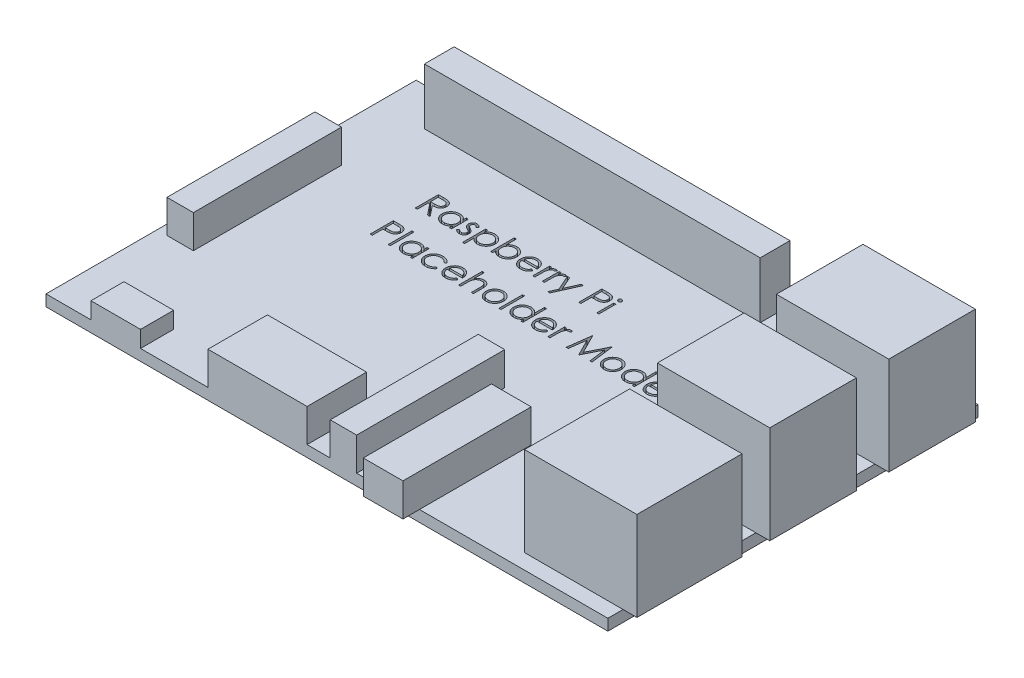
from build123d import *

# Parameters (mm, degrees)
SKETCH1_W           = 85
SKETCH1_H           = 56
BOSS_EXTRUDE1_DEPTH = 1.7
SKETCH2_W           = 50.8
SKETCH2_H           = 4.5
BOSS_EXTRUDE2_DEPTH = 8.5
SKETCH3_W           = 4
SKETCH3_H           = 22.4
SKETCH3_W_2         = 6
SKETCH3_H_2         = 19.4
SKETCH3_W_3         = 15
SKETCH3_H_3         = 9
BOSS_EXTRUDE3_DEPTH = 5
SKETCH4_W           = 7.5
SKETCH4_H           = 5
BOSS_EXTRUDE4_DEPTH = 2.5
SKETCH5_W           = 17
SKETCH5_H           = 13.1
BOSS_EXTRUDE5_DEPTH = 14.8
SKETCH6_W           = 17
SKETCH6_H           = 15.9
BOSS_EXTRUDE6_DEPTH = 13.5
SKETCH7_W           = 0.314102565
SKETCH7_H           = 2.557692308
SKETCH7_W_2         = 0.314102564
SKETCH7_H_2         = 3.589743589
CUT_EXTRUDE1_DEPTH  = 13.5


with BuildPart() as part:
    # Sketch1 → Boss-Extrude1 (new body)
    with BuildSketch(Plane(origin=(0, 0, 0), x_dir=(1, 0, 0), z_dir=(0, 1, 0))):
        Rectangle(SKETCH1_W, SKETCH1_H)
    extrude(amount=BOSS_EXTRUDE1_DEPTH)

    # Sketch2 → Boss-Extrude2 (add)
    with BuildSketch(Plane(origin=(0, 1.7, 0), x_dir=(1, 0, 0), z_dir=(0, 1, 0))):
        with Locations((-10.1, 24.5)):
            Rectangle(SKETCH2_W, SKETCH2_H)
    extrude(amount=BOSS_EXTRUDE2_DEPTH)

    # Sketch3 → Boss-Extrude3 (add)
    with BuildSketch(Plane(origin=(0, 1.7, 0), x_dir=(1, 0, 0), z_dir=(0, 1, 0))):
        with Locations((-39, 0)):
            Rectangle(SKETCH3_W, SKETCH3_H)
        with Locations((2.5, -16.8)):
            Rectangle(SKETCH3_W, SKETCH3_H)
        with Locations((11, -20.8)):
            Rectangle(SKETCH3_W_2, SKETCH3_H_2)
        with Locations((-10.5, -23.5)):
            Rectangle(SKETCH3_W_3, SKETCH3_H_3)
    extrude(amount=BOSS_EXTRUDE3_DEPTH)

    # Sketch4 → Boss-Extrude4 (add)
    with BuildSketch(Plane(origin=(0, 1.7, 0), x_dir=(1, 0, 0), z_dir=(0, 1, 0))):
        with Locations((-31.95, -25.5)):
            Rectangle(SKETCH4_W, SKETCH4_H)
    extrude(amount=BOSS_EXTRUDE4_DEPTH)

    # Sketch5 → Boss-Extrude5 (add)
    with BuildSketch(Plane(origin=(0, 1.7, 0), x_dir=(1, 0, 0), z_dir=(0, 1, 0))):
        with Locations((36.1, 18.95)):
            Rectangle(SKETCH5_W, SKETCH5_H)
        with Locations((36.1, 0.95)):
            Rectangle(SKETCH5_W, SKETCH5_H)
    extrude(amount=BOSS_EXTRUDE5_DEPTH)

    # Sketch6 → Boss-Extrude6 (add)
    with BuildSketch(Plane(origin=(0, 1.7, 0), x_dir=(1, 0, 0), z_dir=(0, 1, 0))):
        with Locations((36.1, -17.75)):
            Rectangle(SKETCH6_W, SKETCH6_H)
    extrude(amount=BOSS_EXTRUDE6_DEPTH)

    # Sketch7 → Cut-Extrude1 (cut)
    # profile 1 of 28: a face of its own
    with BuildSketch(Plane(origin=(0, 1.7, 0), x_dir=(1, 0, 0), z_dir=(0, 1, 0))):
        with BuildLine():
            Line((-25.814763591, 14.686550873), (-25.114342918, 14.686550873))
            add(Edge.make_bspline(
                [(-25.114342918, 14.686550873), (-25.06760179, 14.686395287), (-24.977853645, 14.686096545), (-24.849280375, 14.684430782), (-24.732453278, 14.679656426), (-24.627433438, 14.675547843), (-24.534222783, 14.668055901), (-24.452535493, 14.660895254), (-24.382747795, 14.651521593), (-24.340501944, 14.64281617), (-24.321374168, 14.638874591)],
                knots=[0, 0, 0, 0, 1.410062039, 2.707475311, 3.878576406, 4.937260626, 5.877586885, 6.699081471, 7.410979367, 8, 8, 8, 8], degree=3))
            add(Edge.make_bspline(
                [(-24.321374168, 14.638874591), (-24.295767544, 14.632547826), (-24.245100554, 14.620029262), (-24.172150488, 14.593569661), (-24.102636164, 14.562950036), (-24.03684634, 14.526986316), (-23.975110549, 14.485411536), (-23.916792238, 14.438943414), (-23.861626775, 14.387836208), (-23.811845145, 14.330801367), (-23.764906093, 14.270964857), (-23.725317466, 14.2062611), (-23.691190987, 14.138599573), (-23.66402047, 14.067292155), (-23.642142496, 13.993030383), (-23.626716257, 13.915141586), (-23.617465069, 13.833980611), (-23.616523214, 13.778622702), (-23.616045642, 13.750553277)],
                knots=[0, 0, 0, 0, 1.027469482, 2.033020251, 3.019912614, 3.986113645, 4.951240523, 5.91722682, 6.890402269, 7.87763091, 8.8651537, 9.85103654, 10.82876324, 11.815024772, 12.821070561, 13.842952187, 14.906261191, 16, 16, 16, 16], degree=3))
            add(Edge.make_bspline(
                [(-23.616045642, 13.750553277), (-23.617514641, 13.703918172), (-23.620381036, 13.612921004), (-23.64710614, 13.480860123), (-23.69088266, 13.357670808), (-23.751205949, 13.24350817), (-23.828025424, 13.140597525), (-23.920350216, 13.05020707), (-24.028231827, 12.974567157), (-24.128661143, 12.922114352), (-24.217375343, 12.888521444), (-24.290408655, 12.864885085), (-24.370075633, 12.84662312), (-24.455612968, 12.830262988), (-24.547376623, 12.817911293), (-24.645146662, 12.808864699), (-24.748992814, 12.80321065), (-24.820331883, 12.802368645), (-24.857031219, 12.801935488)],
                knots=[0, 0, 0, 0, 1.260483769, 2.459530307, 3.627416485, 4.787058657, 5.939039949, 7.08810263, 8.267026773, 9.491475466, 10.141966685, 10.831826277, 11.566392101, 12.351337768, 13.187381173, 14.07005841, 15.007169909, 16, 16, 16, 16], degree=3))
            Line((-24.857031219, 12.801935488), (-23.571173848, 11.186550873))
            Line((-23.571173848, 11.186550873), (-23.959595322, 11.186550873))
            Line((-23.959595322, 11.186550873), (-25.245452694, 12.801935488))
            Line((-25.245452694, 12.801935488), (-25.500661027, 12.801935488))
            Line((-25.500661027, 12.801935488), (-25.500661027, 11.186550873))
            Line((-25.500661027, 11.186550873), (-25.814763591, 11.186550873))
            Line((-25.814763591, 11.186550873), (-25.814763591, 14.686550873))
        make_face()
        with BuildLine():
            Line((-25.500661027, 14.327576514), (-25.500661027, 13.160909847))
            Line((-25.500661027, 13.160909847), (-24.859835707, 13.156001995))
            add(Edge.make_bspline(
                [(-24.859835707, 13.156001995), (-24.829915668, 13.155988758), (-24.77192211, 13.155963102), (-24.688021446, 13.159956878), (-24.609901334, 13.164500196), (-24.537860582, 13.171449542), (-24.471867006, 13.180405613), (-24.411953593, 13.191608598), (-24.358022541, 13.20466066), (-24.295124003, 13.224862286), (-24.224887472, 13.256868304), (-24.148556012, 13.303433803), (-24.083553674, 13.362002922), (-24.028635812, 13.428976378), (-23.98450638, 13.502612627), (-23.953394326, 13.582028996), (-23.933651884, 13.665220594), (-23.931323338, 13.722398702), (-23.930148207, 13.751254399)],
                knots=[0, 0, 0, 0, 1.146690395, 2.22261258, 3.21895312, 4.145990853, 4.996080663, 5.770904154, 6.481378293, 7.121626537, 8.300444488, 9.431385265, 10.535395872, 11.636531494, 12.74115979, 13.810798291, 14.895190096, 16, 16, 16, 16], degree=3))
            add(Edge.make_bspline(
                [(-23.930148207, 13.751254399), (-23.931350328, 13.779400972), (-23.933732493, 13.835177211), (-23.953181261, 13.916833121), (-23.986070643, 13.993900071), (-24.030392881, 14.066064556), (-24.084392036, 14.131570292), (-24.147709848, 14.187617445), (-24.218615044, 14.23386691), (-24.284886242, 14.263421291), (-24.344120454, 14.281541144), (-24.395550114, 14.294292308), (-24.453661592, 14.304536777), (-24.518737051, 14.312744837), (-24.590498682, 14.319799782), (-24.669309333, 14.32455156), (-24.754646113, 14.327365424), (-24.813793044, 14.327504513), (-24.844411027, 14.327576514)],
                knots=[0, 0, 0, 0, 1.101028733, 2.181837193, 3.264309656, 4.369019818, 5.486613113, 6.575447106, 7.666700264, 8.788928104, 9.402425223, 10.0903467, 10.862060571, 11.710948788, 12.657782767, 13.684531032, 14.801375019, 16, 16, 16, 16], degree=3))
            Line((-24.844411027, 14.327576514), (-25.500661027, 14.327576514))
        make_face(mode=Mode.SUBTRACT)
    # profile 2 of 28: a face of its own
    with BuildSketch(Plane(origin=(0, 1.7, 0), x_dir=(1, 0, 0), z_dir=(0, 1, 0))):
        with BuildLine():
            Line((-20.340404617, 13.744243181), (-20.340404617, 11.186550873))
            Line((-20.340404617, 11.186550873), (-20.654507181, 11.186550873))
            Line((-20.654507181, 11.186550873), (-20.654507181, 11.628958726))
            add(Edge.make_bspline(
                [(-20.654507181, 11.628958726), (-20.689925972, 11.588919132), (-20.759046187, 11.51078136), (-20.874487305, 11.408699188), (-20.996855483, 11.324320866), (-21.125556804, 11.256170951), (-21.260475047, 11.204978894), (-21.401311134, 11.168592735), (-21.548122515, 11.1451989), (-21.64837487, 11.142862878), (-21.699178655, 11.141679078)],
                knots=[0, 0, 0, 0, 1.074387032, 2.096679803, 3.090159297, 4.057316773, 5.018401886, 5.985159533, 6.978961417, 8, 8, 8, 8], degree=3))
            add(Edge.make_bspline(
                [(-21.699178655, 11.141679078), (-21.744346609, 11.14290545), (-21.833419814, 11.145323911), (-21.964448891, 11.164086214), (-22.090541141, 11.194216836), (-22.211815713, 11.236117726), (-22.327487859, 11.291698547), (-22.438547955, 11.358239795), (-22.544420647, 11.437480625), (-22.643492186, 11.528068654), (-22.734724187, 11.626463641), (-22.814785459, 11.731409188), (-22.881538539, 11.842451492), (-22.93735862, 11.958184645), (-22.980354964, 12.079499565), (-23.010328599, 12.205976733), (-23.029069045, 12.337466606), (-23.031486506, 12.42700613), (-23.032712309, 12.472408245)],
                knots=[0, 0, 0, 0, 1.033919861, 2.038935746, 3.024066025, 3.998881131, 4.97069526, 5.957263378, 6.95902576, 7.993208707, 9.027059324, 10.027763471, 11.009749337, 11.988697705, 12.965288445, 13.950418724, 14.960734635, 16, 16, 16, 16], degree=3))
            add(Edge.make_bspline(
                [(-23.032712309, 12.472408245), (-23.031459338, 12.516871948), (-23.028982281, 12.604774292), (-23.010529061, 12.73405299), (-22.979498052, 12.85857125), (-22.935950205, 12.977928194), (-22.88010825, 13.092268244), (-22.812180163, 13.201672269), (-22.732161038, 13.306441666), (-22.639908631, 13.404112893), (-22.539973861, 13.494333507), (-22.43306513, 13.572742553), (-22.321841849, 13.640459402), (-22.204578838, 13.694112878), (-22.083011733, 13.737521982), (-21.956058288, 13.767554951), (-21.824246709, 13.785252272), (-21.734756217, 13.787815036), (-21.68936295, 13.789114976)],
                knots=[0, 0, 0, 0, 1.020392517, 2.01726096, 2.990465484, 3.961182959, 4.928053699, 5.906110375, 6.912531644, 7.948652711, 8.985773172, 9.998621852, 10.987621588, 11.969261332, 12.953316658, 13.946091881, 14.958173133, 16, 16, 16, 16], degree=3))
            add(Edge.make_bspline(
                [(-21.68936295, 13.789114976), (-21.637163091, 13.787677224), (-21.534801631, 13.784857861), (-21.385073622, 13.761395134), (-21.243429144, 13.721756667), (-21.108774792, 13.667839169), (-20.981594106, 13.596190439), (-20.863091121, 13.505810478), (-20.752025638, 13.397269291), (-20.687645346, 13.313898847), (-20.654507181, 13.270985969)],
                knots=[0, 0, 0, 0, 1.038897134, 2.037228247, 3.008116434, 3.962042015, 4.918381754, 5.904844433, 6.921570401, 8, 8, 8, 8], degree=3))
            Line((-20.654507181, 13.270985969), (-20.654507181, 13.744243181))
            Line((-20.654507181, 13.744243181), (-20.340404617, 13.744243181))
        make_face()
        with BuildLine():
            add(Edge.make_bspline(
                [(-21.685156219, 13.475012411), (-21.731070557, 13.473378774), (-21.821698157, 13.470154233), (-21.954742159, 13.444980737), (-22.082055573, 13.403096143), (-22.203001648, 13.345814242), (-22.315669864, 13.273785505), (-22.416363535, 13.186664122), (-22.505906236, 13.086827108), (-22.581214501, 12.974724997), (-22.642604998, 12.854546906), (-22.685772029, 12.728922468), (-22.714241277, 12.600117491), (-22.717149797, 12.512754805), (-22.718609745, 12.468902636)],
                knots=[0, 0, 0, 0, 1.031046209, 2.035121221, 3.029706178, 4.034933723, 5.034054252, 6.02443088, 7.017295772, 8.038157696, 9.050218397, 10.03989886, 11.016116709, 12, 12, 12, 12], degree=3))
            add(Edge.make_bspline(
                [(-22.718609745, 12.468902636), (-22.716744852, 12.425312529), (-22.713022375, 12.338303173), (-22.68627168, 12.209322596), (-22.641391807, 12.083668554), (-22.580149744, 11.96240756), (-22.50346312, 11.84982346), (-22.414574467, 11.748083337), (-22.312624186, 11.660593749), (-22.199696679, 11.587356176), (-22.079088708, 11.528193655), (-21.952254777, 11.487028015), (-21.821579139, 11.460450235), (-21.732726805, 11.457345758), (-21.687960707, 11.455781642)],
                knots=[0, 0, 0, 0, 0.979072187, 1.954306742, 2.945804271, 3.96968567, 4.997920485, 5.998718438, 6.996577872, 8.005894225, 9.015743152, 10.005417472, 10.995077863, 12, 12, 12, 12], degree=3))
            add(Edge.make_bspline(
                [(-21.687960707, 11.455781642), (-21.642514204, 11.457441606), (-21.552125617, 11.46074311), (-21.418686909, 11.486024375), (-21.289191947, 11.527793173), (-21.165404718, 11.5856923), (-21.050088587, 11.657449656), (-20.946590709, 11.741456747), (-20.859074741, 11.839159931), (-20.784882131, 11.946536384), (-20.726706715, 12.064248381), (-20.684330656, 12.189582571), (-20.65927675, 12.32254332), (-20.65611902, 12.413407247), (-20.654507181, 12.459788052)],
                knots=[0, 0, 0, 0, 1.01762866, 2.023962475, 3.030623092, 4.058876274, 5.077231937, 6.066672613, 7.034107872, 8.005628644, 8.981990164, 9.965428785, 10.961468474, 12, 12, 12, 12], degree=3))
            add(Edge.make_bspline(
                [(-20.654507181, 12.459788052), (-20.655466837, 12.495125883), (-20.657355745, 12.564681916), (-20.671786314, 12.666809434), (-20.694741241, 12.76454316), (-20.727087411, 12.857985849), (-20.769578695, 12.946620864), (-20.820826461, 13.031084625), (-20.881731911, 13.110937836), (-20.951314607, 13.185080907), (-21.027479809, 13.252707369), (-21.10807435, 13.31307161), (-21.194053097, 13.362660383), (-21.283970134, 13.403701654), (-21.377981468, 13.436360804), (-21.476852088, 13.458148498), (-21.579531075, 13.473108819), (-21.64957713, 13.4743712), (-21.685156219, 13.475012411)],
                knots=[0, 0, 0, 0, 1.050140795, 2.067009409, 3.05949893, 4.030605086, 5.00011959, 5.97591094, 6.962425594, 7.979863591, 8.993523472, 9.986985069, 10.967611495, 11.937549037, 12.921786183, 13.919465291, 14.943216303, 16, 16, 16, 16], degree=3))
        make_face(mode=Mode.SUBTRACT)
    # profile 3 of 28: a face of its own
    with BuildSketch(Plane(origin=(0, 1.7, 0), x_dir=(1, 0, 0), z_dir=(0, 1, 0))):
        with BuildLine():
            Line((-18.410917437, 13.425232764), (-18.624058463, 13.205781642))
            add(Edge.make_bspline(
                [(-18.624058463, 13.205781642), (-18.642448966, 13.227094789), (-18.677903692, 13.268184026), (-18.734135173, 13.323121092), (-18.790158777, 13.369258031), (-18.84520759, 13.40821029), (-18.900665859, 13.437659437), (-18.955882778, 13.459154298), (-19.010915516, 13.472456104), (-19.047701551, 13.474170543), (-19.065765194, 13.475012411)],
                knots=[0, 0, 0, 0, 1.26578478, 2.440284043, 3.530471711, 4.527705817, 5.468200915, 6.346673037, 7.188140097, 8, 8, 8, 8], degree=3))
            add(Edge.make_bspline(
                [(-19.065765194, 13.475012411), (-19.087904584, 13.473937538), (-19.131471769, 13.471822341), (-19.193897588, 13.45070891), (-19.251848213, 13.418300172), (-19.302005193, 13.372331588), (-19.344492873, 13.319567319), (-19.375506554, 13.260570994), (-19.394472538, 13.197122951), (-19.39687727, 13.153093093), (-19.398096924, 13.13076161)],
                knots=[0, 0, 0, 0, 0.99966794, 1.967205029, 2.953328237, 3.988086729, 5.028030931, 6.008226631, 6.989793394, 8, 8, 8, 8], degree=3))
            add(Edge.make_bspline(
                [(-19.398096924, 13.13076161), (-19.396986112, 13.110549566), (-19.394767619, 13.070182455), (-19.37752094, 13.010634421), (-19.350054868, 12.952577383), (-19.324384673, 12.917014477), (-19.311157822, 12.898690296)],
                knots=[0, 0, 0, 0, 0.960159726, 1.917612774, 2.927026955, 4, 4, 4, 4], degree=3))
            add(Edge.make_bspline(
                [(-19.311157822, 12.898690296), (-19.303194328, 12.888905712), (-19.286245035, 12.868080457), (-19.25443652, 12.839176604), (-19.218414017, 12.807234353), (-19.17509408, 12.775297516), (-19.126343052, 12.741665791), (-19.071103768, 12.707663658), (-19.011129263, 12.670699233), (-18.968191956, 12.647254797), (-18.945873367, 12.635068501)],
                knots=[0, 0, 0, 0, 0.66740084, 1.420478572, 2.27185888, 3.217733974, 4.268547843, 5.408967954, 6.65319498, 8, 8, 8, 8], degree=3))
            add(Edge.make_bspline(
                [(-18.945873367, 12.635068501), (-18.91865979, 12.619823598), (-18.86609212, 12.590375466), (-18.791399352, 12.544665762), (-18.723612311, 12.499234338), (-18.662156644, 12.454567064), (-18.608214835, 12.409414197), (-18.560150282, 12.36550644), (-18.519161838, 12.321517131), (-18.496207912, 12.290784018), (-18.485236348, 12.276094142)],
                knots=[0, 0, 0, 0, 1.27191281, 2.456916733, 3.569705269, 4.599008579, 5.553216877, 6.436649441, 7.252746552, 8, 8, 8, 8], degree=3))
            add(Edge.make_bspline(
                [(-18.485236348, 12.276094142), (-18.46702582, 12.246428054), (-18.430783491, 12.187387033), (-18.392725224, 12.090168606), (-18.370664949, 11.987058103), (-18.367602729, 11.916525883), (-18.366045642, 11.88066145)],
                knots=[0, 0, 0, 0, 0.995354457, 1.980940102, 2.973342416, 4, 4, 4, 4], degree=3))
            add(Edge.make_bspline(
                [(-18.366045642, 11.88066145), (-18.366765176, 11.855392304), (-18.368183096, 11.805596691), (-18.378041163, 11.732261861), (-18.394996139, 11.662127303), (-18.418089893, 11.594432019), (-18.449274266, 11.530473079), (-18.485822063, 11.46863683), (-18.529696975, 11.410260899), (-18.579788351, 11.355421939), (-18.634633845, 11.305336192), (-18.693139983, 11.261312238), (-18.755378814, 11.224737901), (-18.820905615, 11.194472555), (-18.889869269, 11.170404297), (-18.962280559, 11.153741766), (-19.037909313, 11.143769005), (-19.089339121, 11.142384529), (-19.115544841, 11.141679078)],
                knots=[0, 0, 0, 0, 1.032770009, 2.035186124, 3.017557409, 3.978232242, 4.952395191, 5.920591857, 6.910227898, 7.931268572, 8.952309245, 9.941945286, 10.918353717, 11.897095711, 12.887975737, 13.898235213, 14.929059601, 16, 16, 16, 16], degree=3))
            add(Edge.make_bspline(
                [(-19.115544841, 11.141679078), (-19.150912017, 11.142671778), (-19.221154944, 11.144643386), (-19.325044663, 11.163149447), (-19.426565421, 11.191944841), (-19.524948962, 11.231660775), (-19.617995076, 11.281811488), (-19.703126, 11.341873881), (-19.780637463, 11.409863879), (-19.824755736, 11.461976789), (-19.846814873, 11.488033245)],
                knots=[0, 0, 0, 0, 1.013940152, 2.01379169, 3.017749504, 4.037548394, 5.051665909, 6.043208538, 7.021604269, 8, 8, 8, 8], degree=3))
            Line((-19.846814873, 11.488033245), (-19.6385817, 11.725012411))
            add(Edge.make_bspline(
                [(-19.6385817, 11.725012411), (-19.618809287, 11.703657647), (-19.580477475, 11.662258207), (-19.519176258, 11.607133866), (-19.456796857, 11.560932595), (-19.39396217, 11.52228918), (-19.329742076, 11.492513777), (-19.264496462, 11.471595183), (-19.198358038, 11.458150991), (-19.153935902, 11.456572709), (-19.131670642, 11.455781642)],
                knots=[0, 0, 0, 0, 1.179806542, 2.287233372, 3.337373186, 4.324005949, 5.273901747, 6.200048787, 7.097828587, 8, 8, 8, 8], degree=3))
            add(Edge.make_bspline(
                [(-19.131670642, 11.455781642), (-19.101352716, 11.457152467), (-19.042116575, 11.459830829), (-18.957272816, 11.484147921), (-18.87893419, 11.522277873), (-18.810910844, 11.576362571), (-18.753008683, 11.639318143), (-18.711080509, 11.710232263), (-18.684804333, 11.787023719), (-18.681718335, 11.840256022), (-18.680148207, 11.867340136)],
                knots=[0, 0, 0, 0, 1.072336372, 2.095165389, 3.102688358, 4.141489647, 5.156069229, 6.117746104, 7.042326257, 8, 8, 8, 8], degree=3))
            add(Edge.make_bspline(
                [(-18.680148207, 11.867340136), (-18.681234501, 11.889649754), (-18.683379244, 11.93369711), (-18.700222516, 11.997447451), (-18.726835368, 12.057916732), (-18.753040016, 12.093306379), (-18.766386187, 12.11133052)],
                knots=[0, 0, 0, 0, 1.013901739, 2.00181326, 2.98231254, 4, 4, 4, 4], degree=3))
            add(Edge.make_bspline(
                [(-18.766386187, 12.11133052), (-18.774408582, 12.120365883), (-18.791884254, 12.140048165), (-18.823939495, 12.168473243), (-18.862321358, 12.199111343), (-18.907461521, 12.231442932), (-18.959450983, 12.265041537), (-19.018500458, 12.299730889), (-19.08380101, 12.337158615), (-19.129971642, 12.36197827), (-19.15410654, 12.374952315)],
                knots=[0, 0, 0, 0, 0.615000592, 1.339693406, 2.178160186, 3.116406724, 4.166410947, 5.330106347, 6.604359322, 8, 8, 8, 8], degree=3))
            add(Edge.make_bspline(
                [(-19.15410654, 12.374952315), (-19.18015318, 12.389491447), (-19.230665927, 12.417687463), (-19.302213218, 12.461603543), (-19.366760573, 12.506270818), (-19.425861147, 12.549183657), (-19.478022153, 12.592604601), (-19.523038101, 12.636581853), (-19.562681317, 12.679341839), (-19.584628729, 12.709639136), (-19.595112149, 12.724110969)],
                knots=[0, 0, 0, 0, 1.262093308, 2.447601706, 3.550203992, 4.582594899, 5.537233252, 6.418365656, 7.244515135, 8, 8, 8, 8], degree=3))
            add(Edge.make_bspline(
                [(-19.595112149, 12.724110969), (-19.613242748, 12.753256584), (-19.649510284, 12.811557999), (-19.684725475, 12.908868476), (-19.708931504, 13.011313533), (-19.711093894, 13.082000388), (-19.712199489, 13.118141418)],
                knots=[0, 0, 0, 0, 0.985009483, 1.970363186, 2.962279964, 4, 4, 4, 4], degree=3))
            add(Edge.make_bspline(
                [(-19.712199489, 13.118141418), (-19.711665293, 13.141766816), (-19.710619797, 13.188005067), (-19.702275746, 13.255943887), (-19.687084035, 13.320492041), (-19.668029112, 13.382618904), (-19.641546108, 13.441120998), (-19.609900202, 13.496778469), (-19.572712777, 13.549514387), (-19.529869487, 13.598517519), (-19.482762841, 13.643026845), (-19.431868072, 13.681825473), (-19.378329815, 13.714931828), (-19.321921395, 13.742696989), (-19.262100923, 13.763698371), (-19.199286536, 13.778155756), (-19.133605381, 13.787810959), (-19.088704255, 13.788674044), (-19.065765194, 13.789114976)],
                knots=[0, 0, 0, 0, 1.087655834, 2.128696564, 3.144119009, 4.137814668, 5.115653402, 6.093965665, 7.082169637, 8.081268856, 9.086088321, 10.061021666, 11.022561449, 11.980240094, 12.950172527, 13.934149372, 14.944599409, 16, 16, 16, 16], degree=3))
            add(Edge.make_bspline(
                [(-19.065765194, 13.789114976), (-19.03857313, 13.788010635), (-18.983678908, 13.785781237), (-18.901324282, 13.768075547), (-18.81909094, 13.738942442), (-18.73676759, 13.698706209), (-18.654957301, 13.646639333), (-18.572940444, 13.583710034), (-18.489732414, 13.510332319), (-18.437776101, 13.454233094), (-18.410917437, 13.425232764)],
                knots=[0, 0, 0, 0, 0.845714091, 1.707292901, 2.609013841, 3.555613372, 4.552488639, 5.621697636, 6.770543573, 8, 8, 8, 8], degree=3))
        make_face()
    # profile 4 of 28: a face of its own
    with BuildSketch(Plane(origin=(0, 1.7, 0), x_dir=(1, 0, 0), z_dir=(0, 1, 0))):
        with BuildLine():
            Line((-17.737840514, 13.744243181), (-17.42373795, 13.744243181))
            Line((-17.42373795, 13.744243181), (-17.42373795, 13.270985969))
            add(Edge.make_bspline(
                [(-17.42373795, 13.270985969), (-17.390380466, 13.313923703), (-17.325556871, 13.397364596), (-17.213831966, 13.505354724), (-17.095905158, 13.596430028), (-16.968741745, 13.667812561), (-16.834318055, 13.721633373), (-16.693185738, 13.761412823), (-16.544146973, 13.784854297), (-16.44225052, 13.787675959), (-16.390284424, 13.789114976)],
                knots=[0, 0, 0, 0, 1.0828784, 2.104357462, 3.088488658, 4.04616522, 5.001424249, 5.969181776, 6.964304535, 8, 8, 8, 8], degree=3))
            add(Edge.make_bspline(
                [(-16.390284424, 13.789114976), (-16.344892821, 13.787801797), (-16.255173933, 13.78520623), (-16.123110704, 13.767633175), (-15.995935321, 13.737515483), (-15.874367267, 13.694114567), (-15.757104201, 13.640459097), (-15.645882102, 13.572742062), (-15.538968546, 13.494335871), (-15.439052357, 13.40410372), (-15.346730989, 13.306475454), (-15.266884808, 13.20145315), (-15.198012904, 13.092490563), (-15.142342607, 12.977898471), (-15.09873426, 12.858579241), (-15.067719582, 12.7340508), (-15.049261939, 12.60477486), (-15.046785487, 12.516872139), (-15.045532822, 12.472408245)],
                knots=[0, 0, 0, 0, 1.041296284, 2.058176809, 3.050446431, 4.034000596, 5.01514041, 6.003636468, 7.015969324, 8.052561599, 9.08815499, 10.094063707, 11.074456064, 12.040834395, 13.011057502, 13.983766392, 14.980127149, 16, 16, 16, 16], degree=3))
            add(Edge.make_bspline(
                [(-15.045532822, 12.472408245), (-15.046758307, 12.427005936), (-15.049175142, 12.337466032), (-15.067920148, 12.205978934), (-15.097877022, 12.079491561), (-15.140935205, 11.958214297), (-15.196576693, 11.842230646), (-15.264281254, 11.73162425), (-15.344167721, 11.626430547), (-15.435468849, 11.528077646), (-15.534521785, 11.437478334), (-15.640399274, 11.358240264), (-15.7514582, 11.291698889), (-15.867130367, 11.236115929), (-15.988406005, 11.194223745), (-16.114719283, 11.164005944), (-16.24600143, 11.145371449), (-16.335302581, 11.142919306), (-16.380468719, 11.141679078)],
                knots=[0, 0, 0, 0, 1.038740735, 2.04854663, 3.033179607, 4.009277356, 4.987731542, 5.972001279, 6.972200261, 8.005528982, 9.039189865, 10.040446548, 11.026516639, 11.997840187, 12.972163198, 13.956796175, 14.96660207, 16, 16, 16, 16], degree=3))
            add(Edge.make_bspline(
                [(-16.380468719, 11.141679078), (-16.431296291, 11.142973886), (-16.531695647, 11.145531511), (-16.678493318, 11.171450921), (-16.81977017, 11.210187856), (-16.953960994, 11.26688685), (-17.082128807, 11.339142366), (-17.203548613, 11.427252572), (-17.318865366, 11.531033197), (-17.388274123, 11.609765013), (-17.42373795, 11.649992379)],
                knots=[0, 0, 0, 0, 1.014726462, 2.004382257, 2.969841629, 3.936926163, 4.907207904, 5.903978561, 6.929055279, 8, 8, 8, 8], degree=3))
            Line((-17.42373795, 11.649992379), (-17.42373795, 10.244243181))
            Line((-17.42373795, 10.244243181), (-17.737840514, 10.244243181))
            Line((-17.737840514, 10.244243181), (-17.737840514, 13.744243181))
        make_face()
        with BuildLine():
            add(Edge.make_bspline(
                [(-16.393088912, 13.475012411), (-16.428668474, 13.474372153), (-16.498715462, 13.47311165), (-16.601387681, 13.458137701), (-16.700283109, 13.43639996), (-16.79440506, 13.40348806), (-16.884655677, 13.363089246), (-16.970339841, 13.312607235), (-17.051397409, 13.252955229), (-17.127624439, 13.185275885), (-17.196487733, 13.110701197), (-17.257450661, 13.031113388), (-17.308657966, 12.946613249), (-17.351159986, 12.857987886), (-17.383503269, 12.764542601), (-17.406458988, 12.666809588), (-17.420889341, 12.564681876), (-17.422778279, 12.495125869), (-17.42373795, 12.459788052)],
                knots=[0, 0, 0, 0, 1.05670511, 2.080379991, 3.077984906, 4.06214886, 5.038337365, 6.01289324, 7.01187578, 8.025460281, 9.038092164, 10.024533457, 11.000252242, 11.969694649, 12.940728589, 13.933144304, 14.949937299, 16, 16, 16, 16], degree=3))
            add(Edge.make_bspline(
                [(-17.42373795, 12.459788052), (-17.422147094, 12.41339994), (-17.419030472, 12.322521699), (-17.393693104, 12.189737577), (-17.35245784, 12.064085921), (-17.293929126, 11.946624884), (-17.219981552, 11.838642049), (-17.130883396, 11.741951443), (-17.027440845, 11.657160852), (-16.911373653, 11.585739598), (-16.786951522, 11.527751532), (-16.65716561, 11.486237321), (-16.52380073, 11.460665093), (-16.43363241, 11.457418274), (-16.388181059, 11.455781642)],
                knots=[0, 0, 0, 0, 1.03728447, 2.032128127, 3.01272805, 3.987917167, 4.958271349, 5.931593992, 6.91984656, 7.941419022, 8.973179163, 9.983609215, 10.983593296, 12, 12, 12, 12], degree=3))
            add(Edge.make_bspline(
                [(-16.388181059, 11.455781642), (-16.343645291, 11.457338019), (-16.255249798, 11.460427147), (-16.125091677, 11.487165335), (-15.998601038, 11.52801036), (-15.878420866, 11.587569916), (-15.765597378, 11.660559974), (-15.663715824, 11.748120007), (-15.574708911, 11.84960995), (-15.498844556, 11.962618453), (-15.437713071, 12.083793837), (-15.391782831, 12.209175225), (-15.365274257, 12.338320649), (-15.361517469, 12.425318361), (-15.359635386, 12.468902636)],
                knots=[0, 0, 0, 0, 1.00104056, 1.986885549, 2.97790532, 3.984399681, 4.995088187, 5.994304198, 6.996462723, 8.023150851, 9.048424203, 10.043036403, 11.019596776, 12, 12, 12, 12], degree=3))
            add(Edge.make_bspline(
                [(-15.359635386, 12.468902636), (-15.36109012, 12.512757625), (-15.363988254, 12.600125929), (-15.392535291, 12.728888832), (-15.435435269, 12.854776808), (-15.497994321, 12.974297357), (-15.57219559, 13.08707144), (-15.661942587, 13.186625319), (-15.762558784, 13.273795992), (-15.875247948, 13.345811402), (-15.996188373, 13.403096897), (-16.123503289, 13.444980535), (-16.256546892, 13.470154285), (-16.347174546, 13.473378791), (-16.393088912, 13.475012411)],
                knots=[0, 0, 0, 0, 0.983928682, 1.960191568, 2.949917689, 3.96440592, 4.982380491, 5.975291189, 6.965713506, 7.964880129, 8.970154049, 9.96478489, 10.968906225, 12, 12, 12, 12], degree=3))
        make_face(mode=Mode.SUBTRACT)
    # profile 5 of 28: a face of its own
    with BuildSketch(Plane(origin=(0, 1.7, 0), x_dir=(1, 0, 0), z_dir=(0, 1, 0))):
        with BuildLine():
            Line((-14.417327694, 11.186550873), (-14.417327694, 14.776294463))
            Line((-14.417327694, 14.776294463), (-14.10322513, 14.776294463))
            Line((-14.10322513, 14.776294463), (-14.10322513, 13.280100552))
            add(Edge.make_bspline(
                [(-14.10322513, 13.280100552), (-14.067831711, 13.320858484), (-13.998777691, 13.40037889), (-13.88300124, 13.504226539), (-13.76159567, 13.592279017), (-13.633637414, 13.664865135), (-13.498944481, 13.720138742), (-13.358212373, 13.760561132), (-13.211081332, 13.784948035), (-13.110762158, 13.787714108), (-13.059955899, 13.789114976)],
                knots=[0, 0, 0, 0, 1.077089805, 2.101446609, 3.097517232, 4.067117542, 5.031729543, 5.997785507, 6.985986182, 8, 8, 8, 8], degree=3))
            add(Edge.make_bspline(
                [(-13.059955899, 13.789114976), (-13.014789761, 13.787874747), (-12.925488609, 13.785422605), (-12.794206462, 13.766788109), (-12.667893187, 13.736570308), (-12.546617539, 13.694678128), (-12.430945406, 13.639095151), (-12.319886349, 13.572553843), (-12.214009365, 13.493315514), (-12.114954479, 13.402717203), (-12.023660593, 13.304360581), (-11.943748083, 13.199180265), (-11.876248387, 13.088705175), (-11.820417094, 12.973305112), (-11.777246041, 12.852508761), (-11.747503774, 12.726434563), (-11.72861031, 12.595206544), (-11.726230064, 12.50589374), (-11.725020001, 12.460489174)],
                knots=[0, 0, 0, 0, 1.034377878, 2.045141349, 3.03070803, 4.00595497, 4.978199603, 5.965204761, 6.967410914, 8.002051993, 9.036360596, 10.037508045, 11.022711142, 11.997267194, 12.969246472, 13.954813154, 14.960274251, 16, 16, 16, 16], degree=3))
            add(Edge.make_bspline(
                [(-11.725020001, 12.460489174), (-11.726256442, 12.415789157), (-11.728694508, 12.327647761), (-11.747315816, 12.197941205), (-11.778062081, 12.073102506), (-11.822023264, 11.953454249), (-11.877288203, 11.838434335), (-11.946399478, 11.729353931), (-12.026210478, 11.624314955), (-12.118541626, 11.526691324), (-12.218455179, 11.436457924), (-12.325369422, 11.358052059), (-12.436591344, 11.290334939), (-12.553854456, 11.236679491), (-12.675422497, 11.19327857), (-12.802597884, 11.163160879), (-12.934661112, 11.145587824), (-13.024380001, 11.142992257), (-13.069771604, 11.141679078)],
                knots=[0, 0, 0, 0, 1.024244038, 2.01964794, 2.996620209, 3.965911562, 4.936179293, 5.91563013, 6.920572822, 7.955171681, 8.990768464, 10.002129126, 10.989675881, 11.969873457, 12.952483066, 13.943799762, 14.959703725, 16, 16, 16, 16], degree=3))
            add(Edge.make_bspline(
                [(-13.069771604, 11.141679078), (-13.121736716, 11.143119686), (-13.223631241, 11.145944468), (-13.372683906, 11.169363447), (-13.513765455, 11.209225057), (-13.648483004, 11.262786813), (-13.774910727, 11.335315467), (-13.893851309, 11.425272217), (-14.004554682, 11.534139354), (-14.069771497, 11.617200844), (-14.10322513, 11.659808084)],
                knots=[0, 0, 0, 0, 1.035807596, 2.031038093, 2.998900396, 3.954262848, 4.914341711, 5.895762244, 6.92060972, 8, 8, 8, 8], degree=3))
            Line((-14.10322513, 11.659808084), (-14.10322513, 11.186550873))
            Line((-14.10322513, 11.186550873), (-14.417327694, 11.186550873))
        make_face()
        with BuildLine():
            add(Edge.make_bspline(
                [(-13.072576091, 11.455781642), (-13.026661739, 11.457415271), (-12.93603411, 11.460639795), (-12.802990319, 11.485813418), (-12.67567611, 11.527697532), (-12.554733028, 11.58498124), (-12.442053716, 11.657003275), (-12.341401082, 11.744149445), (-12.251921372, 11.84365096), (-12.177269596, 11.955884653), (-12.114943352, 12.075335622), (-12.072130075, 12.200989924), (-12.043410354, 12.329484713), (-12.040558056, 12.416630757), (-12.039122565, 12.460489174)],
                knots=[0, 0, 0, 0, 1.031910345, 2.036826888, 3.032245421, 4.038315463, 5.03827337, 6.029480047, 7.023177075, 8.037597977, 9.052889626, 10.043399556, 11.015292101, 12, 12, 12, 12], degree=3))
            add(Edge.make_bspline(
                [(-12.039122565, 12.460489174), (-12.041010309, 12.504304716), (-12.044778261, 12.591760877), (-12.071153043, 12.721410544), (-12.117210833, 12.846998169), (-12.178328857, 12.968176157), (-12.254196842, 13.081183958), (-12.343202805, 13.182674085), (-12.445084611, 13.270234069), (-12.557908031, 13.34322414), (-12.678088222, 13.402783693), (-12.804578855, 13.443628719), (-12.934736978, 13.470366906), (-13.023132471, 13.473456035), (-13.067668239, 13.475012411)],
                knots=[0, 0, 0, 0, 0.984795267, 1.965658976, 2.959410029, 3.983795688, 5.009594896, 6.01088574, 7.009236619, 8.019050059, 9.024672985, 10.014834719, 10.999826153, 12, 12, 12, 12], degree=3))
            add(Edge.make_bspline(
                [(-13.067668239, 13.475012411), (-13.113135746, 13.473456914), (-13.203379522, 13.470369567), (-13.336547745, 13.443581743), (-13.466611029, 13.402534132), (-13.59089856, 13.343602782), (-13.706752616, 13.271491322), (-13.810365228, 13.186751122), (-13.899696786, 13.089971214), (-13.973240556, 12.981465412), (-14.031645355, 12.864280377), (-14.073429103, 12.739268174), (-14.09842875, 12.607086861), (-14.101606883, 12.516453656), (-14.10322513, 12.470304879)],
                knots=[0, 0, 0, 0, 1.016820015, 2.018181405, 3.029022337, 4.06341356, 5.088169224, 6.076823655, 7.05054209, 8.02560866, 9.001194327, 9.972267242, 10.967515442, 12, 12, 12, 12], degree=3))
            add(Edge.make_bspline(
                [(-14.10322513, 12.470304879), (-14.102265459, 12.434967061), (-14.100376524, 12.365411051), (-14.085946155, 12.263283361), (-14.062990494, 12.165550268), (-14.030647, 12.072105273), (-13.988145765, 11.983478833), (-13.936935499, 11.898982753), (-13.875983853, 11.819379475), (-13.807077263, 11.744864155), (-13.731114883, 11.67705474), (-13.649591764, 11.618276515), (-13.564173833, 11.567662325), (-13.473883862, 11.527317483), (-13.379772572, 11.494390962), (-13.280874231, 11.472657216), (-13.178202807, 11.457682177), (-13.108155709, 11.456421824), (-13.072576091, 11.455781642)],
                knots=[0, 0, 0, 0, 1.050331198, 2.067384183, 3.060053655, 4.031335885, 5.001026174, 5.976994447, 6.963687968, 7.976578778, 8.990422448, 9.985569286, 10.960374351, 11.936812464, 12.921228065, 13.919088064, 14.943024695, 16, 16, 16, 16], degree=3))
        make_face(mode=Mode.SUBTRACT)
    # profile 6 of 28: a face of its own
    with BuildSketch(Plane(origin=(0, 1.7, 0), x_dir=(1, 0, 0), z_dir=(0, 1, 0))):
        with BuildLine():
            Line((-8.997656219, 11.994243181), (-8.718609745, 11.847708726))
            add(Edge.make_bspline(
                [(-8.718609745, 11.847708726), (-8.74084634, 11.808265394), (-8.784109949, 11.731524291), (-8.858510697, 11.626092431), (-8.936502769, 11.531244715), (-9.021606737, 11.449515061), (-9.111276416, 11.378263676), (-9.206009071, 11.315925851), (-9.306297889, 11.262807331), (-9.412147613, 11.218054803), (-9.524447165, 11.183645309), (-9.643468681, 11.159341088), (-9.769440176, 11.144317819), (-9.855786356, 11.142572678), (-9.899999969, 11.141679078)],
                knots=[0, 0, 0, 0, 1.120438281, 2.179929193, 3.190490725, 4.156257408, 5.095198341, 6.022838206, 6.959905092, 7.901321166, 8.864066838, 9.862729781, 10.905609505, 12, 12, 12, 12], degree=3))
            add(Edge.make_bspline(
                [(-9.899999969, 11.141679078), (-9.949141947, 11.142826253), (-10.045003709, 11.14506406), (-10.184543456, 11.164356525), (-10.315922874, 11.195828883), (-10.439134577, 11.239794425), (-10.55387683, 11.297221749), (-10.660377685, 11.367181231), (-10.759197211, 11.449313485), (-10.84722142, 11.544329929), (-10.926465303, 11.646011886), (-10.996391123, 11.751967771), (-11.054848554, 11.861930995), (-11.102401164, 11.975201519), (-11.140806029, 12.091065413), (-11.167572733, 12.21057688), (-11.18300248, 12.333412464), (-11.185366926, 12.4165098), (-11.186558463, 12.458385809)],
                knots=[0, 0, 0, 0, 1.145258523, 2.234067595, 3.276747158, 4.290159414, 5.277019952, 6.260822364, 7.254936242, 8.264827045, 9.274100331, 10.257902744, 11.220704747, 12.172965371, 13.118907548, 14.062713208, 15.023725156, 16, 16, 16, 16], degree=3))
            add(Edge.make_bspline(
                [(-11.186558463, 12.458385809), (-11.185499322, 12.497680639), (-11.183400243, 12.575557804), (-11.170169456, 12.690823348), (-11.146721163, 12.802851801), (-11.114544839, 12.911736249), (-11.072993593, 13.017294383), (-11.022161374, 13.119590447), (-10.961968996, 13.218515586), (-10.915496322, 13.28091872), (-10.892087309, 13.312352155)],
                knots=[0, 0, 0, 0, 1.024358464, 2.0301432, 3.019427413, 4.004406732, 4.986367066, 5.972626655, 6.978780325, 8, 8, 8, 8], degree=3))
            add(Edge.make_bspline(
                [(-10.892087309, 13.312352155), (-10.860379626, 13.350221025), (-10.79796868, 13.424759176), (-10.692412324, 13.522697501), (-10.578112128, 13.604741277), (-10.456500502, 13.672748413), (-10.326164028, 13.72442206), (-10.188854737, 13.762929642), (-10.043009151, 13.784507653), (-9.94330393, 13.787555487), (-9.89228763, 13.789114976)],
                knots=[0, 0, 0, 0, 1.030682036, 2.02871468, 2.997146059, 3.962720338, 4.930598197, 5.918074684, 6.934738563, 8, 8, 8, 8], degree=3))
            add(Edge.make_bspline(
                [(-9.89228763, 13.789114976), (-9.839840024, 13.787760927), (-9.736949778, 13.785104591), (-9.586917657, 13.760478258), (-9.444956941, 13.721425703), (-9.311124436, 13.666271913), (-9.185406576, 13.595112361), (-9.068620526, 13.50697052), (-8.958769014, 13.404552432), (-8.894860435, 13.325789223), (-8.862339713, 13.285709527)],
                knots=[0, 0, 0, 0, 1.056321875, 2.072262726, 3.055038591, 4.01806755, 4.982017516, 5.957941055, 6.960871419, 8, 8, 8, 8], degree=3))
            add(Edge.make_bspline(
                [(-8.862339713, 13.285709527), (-8.840212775, 13.255505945), (-8.796106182, 13.195299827), (-8.740859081, 13.09712867), (-8.692901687, 12.994418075), (-8.654568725, 12.885507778), (-8.623529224, 12.771688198), (-8.601072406, 12.652145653), (-8.587902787, 12.526915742), (-8.58531409, 12.441589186), (-8.58399436, 12.398089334)],
                knots=[0, 0, 0, 0, 0.94817472, 1.890038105, 2.849395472, 3.817997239, 4.812318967, 5.836947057, 6.897266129, 8, 8, 8, 8], degree=3))
            Line((-8.58399436, 12.398089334), (-10.872455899, 12.398089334))
            add(Edge.make_bspline(
                [(-10.872455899, 12.398089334), (-10.870916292, 12.36438887), (-10.867888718, 12.298118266), (-10.853773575, 12.201147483), (-10.831524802, 12.108774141), (-10.800255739, 12.021691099), (-10.762388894, 11.938760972), (-10.716003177, 11.860598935), (-10.660663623, 11.787561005), (-10.598937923, 11.718993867), (-10.530230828, 11.657933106), (-10.457948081, 11.60328133), (-10.381054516, 11.557475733), (-10.300156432, 11.520295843), (-10.215384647, 11.491189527), (-10.126712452, 11.471321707), (-10.034314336, 11.4580146), (-9.971328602, 11.456534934), (-9.93926279, 11.455781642)],
                knots=[0, 0, 0, 0, 1.094153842, 2.151609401, 3.174256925, 4.172055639, 5.149267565, 6.128595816, 7.11444997, 8.118368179, 9.117203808, 10.09244225, 11.054858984, 12.015122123, 12.976791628, 13.957293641, 14.960065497, 16, 16, 16, 16], degree=3))
            add(Edge.make_bspline(
                [(-9.93926279, 11.455781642), (-9.907911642, 11.456389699), (-9.845704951, 11.4575962), (-9.753064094, 11.469328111), (-9.661924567, 11.488298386), (-9.572663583, 11.514188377), (-9.487092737, 11.545765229), (-9.407847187, 11.583868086), (-9.334966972, 11.626017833), (-9.266850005, 11.674227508), (-9.200779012, 11.733235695), (-9.135236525, 11.806871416), (-9.064959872, 11.893958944), (-9.020970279, 11.95950461), (-8.997656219, 11.994243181)],
                knots=[0, 0, 0, 0, 0.99110716, 1.966546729, 2.947904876, 3.932708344, 4.903319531, 5.828989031, 6.710028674, 7.56322171, 8.463672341, 9.504779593, 10.677557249, 12, 12, 12, 12], degree=3))
        make_face()
        with BuildLine():
            add(Edge.make_bspline(
                [(-8.898096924, 12.712191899), (-8.909593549, 12.753854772), (-8.931720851, 12.834042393), (-8.977957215, 12.945083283), (-9.030028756, 13.043771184), (-9.091650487, 13.129350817), (-9.161469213, 13.20535433), (-9.242114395, 13.271772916), (-9.332550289, 13.331190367), (-9.432309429, 13.381342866), (-9.537951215, 13.424032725), (-9.648557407, 13.452657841), (-9.761415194, 13.472267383), (-9.837749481, 13.474093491), (-9.876161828, 13.475012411)],
                knots=[0, 0, 0, 0, 1.154881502, 2.222775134, 3.210006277, 4.132804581, 5.035138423, 5.962687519, 6.919655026, 7.923214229, 8.944639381, 9.960483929, 10.97369054, 12, 12, 12, 12], degree=3))
            add(Edge.make_bspline(
                [(-9.876161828, 13.475012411), (-9.907511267, 13.47440074), (-9.969482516, 13.473191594), (-10.060783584, 13.461721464), (-10.148463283, 13.44276162), (-10.233168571, 13.416796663), (-10.313789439, 13.382188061), (-10.391984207, 13.341604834), (-10.465764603, 13.29206325), (-10.511905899, 13.254304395), (-10.535216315, 13.235228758)],
                knots=[0, 0, 0, 0, 1.04873581, 2.073130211, 3.073294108, 4.04793562, 5.032784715, 6.005352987, 6.992311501, 8, 8, 8, 8], degree=3))
            add(Edge.make_bspline(
                [(-10.535216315, 13.235228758), (-10.551909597, 13.220134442), (-10.585692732, 13.189587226), (-10.630833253, 13.136958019), (-10.674053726, 13.080206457), (-10.713387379, 13.017161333), (-10.749464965, 12.948540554), (-10.783224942, 12.874922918), (-10.813611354, 12.795749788), (-10.830707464, 12.740577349), (-10.839503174, 12.712191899)],
                knots=[0, 0, 0, 0, 0.879870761, 1.780643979, 2.707998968, 3.669668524, 4.684282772, 5.740141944, 6.837334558, 8, 8, 8, 8], degree=3))
            Line((-10.839503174, 12.712191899), (-8.898096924, 12.712191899))
        make_face(mode=Mode.SUBTRACT)
    # profile 7 of 28: a face of its own
    with BuildSketch(Plane(origin=(0, 1.7, 0), x_dir=(1, 0, 0), z_dir=(0, 1, 0))):
        with BuildLine():
            Line((-8.045532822, 13.744243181), (-7.731430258, 13.744243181))
            Line((-7.731430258, 13.744243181), (-7.731430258, 13.367740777))
            add(Edge.make_bspline(
                [(-7.731430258, 13.367740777), (-7.708241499, 13.402796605), (-7.663893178, 13.469840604), (-7.590180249, 13.558509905), (-7.514676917, 13.631924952), (-7.43702173, 13.690428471), (-7.35664363, 13.73424159), (-7.275306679, 13.766334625), (-7.191731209, 13.78531194), (-7.135569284, 13.787845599), (-7.10743186, 13.789114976)],
                knots=[0, 0, 0, 0, 1.2804753, 2.448899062, 3.506932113, 4.484331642, 5.4025378, 6.288909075, 7.142734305, 8, 8, 8, 8], degree=3))
            add(Edge.make_bspline(
                [(-7.10743186, 13.789114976), (-7.085605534, 13.787924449), (-7.040696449, 13.785474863), (-6.972713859, 13.768264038), (-6.902670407, 13.740786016), (-6.85752802, 13.714945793), (-6.83399436, 13.701474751)],
                knots=[0, 0, 0, 0, 0.901110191, 1.854092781, 2.881294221, 4, 4, 4, 4], degree=3))
            Line((-6.83399436, 13.701474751), (-7.006470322, 13.429439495))
            add(Edge.make_bspline(
                [(-7.006470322, 13.429439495), (-7.021579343, 13.436179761), (-7.050259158, 13.448974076), (-7.092213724, 13.464116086), (-7.130895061, 13.473032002), (-7.155538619, 13.47438272), (-7.167027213, 13.475012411)],
                knots=[0, 0, 0, 0, 1.180555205, 2.24091978, 3.179933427, 4, 4, 4, 4], degree=3))
            add(Edge.make_bspline(
                [(-7.167027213, 13.475012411), (-7.192232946, 13.473332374), (-7.243645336, 13.469905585), (-7.319129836, 13.442966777), (-7.392377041, 13.399441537), (-7.450548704, 13.351170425), (-7.495590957, 13.304622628), (-7.527731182, 13.263974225), (-7.557213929, 13.218395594), (-7.585384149, 13.16866591), (-7.611050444, 13.113936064), (-7.635005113, 13.05475285), (-7.656663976, 12.991047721), (-7.66901422, 12.946665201), (-7.675340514, 12.923930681)],
                knots=[0, 0, 0, 0, 1.125678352, 2.296057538, 3.5422874, 4.923748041, 5.663163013, 6.437101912, 7.23742474, 8.08941207, 8.991984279, 9.93940061, 10.944477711, 12, 12, 12, 12], degree=3))
            add(Edge.make_bspline(
                [(-7.675340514, 12.923930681), (-7.680072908, 12.903653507), (-7.690554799, 12.858741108), (-7.700746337, 12.783392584), (-7.710815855, 12.694368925), (-7.717912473, 12.591422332), (-7.724490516, 12.474809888), (-7.728200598, 12.344353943), (-7.731303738, 12.199920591), (-7.731386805, 12.098946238), (-7.731430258, 12.046126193)],
                knots=[0, 0, 0, 0, 0.566838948, 1.255505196, 2.06880316, 3.007127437, 4.065329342, 5.249902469, 6.561414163, 8, 8, 8, 8], degree=3))
            Line((-7.731430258, 12.046126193), (-7.731430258, 11.186550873))
            Line((-7.731430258, 11.186550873), (-8.045532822, 11.186550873))
            Line((-8.045532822, 11.186550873), (-8.045532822, 13.744243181))
        make_face()
    # profile 8 of 28: a face of its own
    with BuildSketch(Plane(origin=(0, 1.7, 0), x_dir=(1, 0, 0), z_dir=(0, 1, 0))):
        with BuildLine():
            Line((-6.609635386, 13.744243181), (-6.295532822, 13.744243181))
            Line((-6.295532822, 13.744243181), (-6.295532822, 13.367740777))
            add(Edge.make_bspline(
                [(-6.295532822, 13.367740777), (-6.272344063, 13.402796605), (-6.227995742, 13.469840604), (-6.154282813, 13.558509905), (-6.078779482, 13.631924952), (-6.001124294, 13.690428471), (-5.920746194, 13.73424159), (-5.839409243, 13.766334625), (-5.755833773, 13.78531194), (-5.699671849, 13.787845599), (-5.671534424, 13.789114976)],
                knots=[0, 0, 0, 0, 1.2804753, 2.448899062, 3.506932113, 4.484331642, 5.4025378, 6.288909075, 7.142734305, 8, 8, 8, 8], degree=3))
            add(Edge.make_bspline(
                [(-5.671534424, 13.789114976), (-5.649708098, 13.787924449), (-5.604799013, 13.785474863), (-5.536816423, 13.768264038), (-5.466772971, 13.740786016), (-5.421630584, 13.714945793), (-5.398096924, 13.701474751)],
                knots=[0, 0, 0, 0, 0.901110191, 1.854092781, 2.881294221, 4, 4, 4, 4], degree=3))
            Line((-5.398096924, 13.701474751), (-5.570572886, 13.429439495))
            add(Edge.make_bspline(
                [(-5.570572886, 13.429439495), (-5.585681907, 13.436179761), (-5.614361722, 13.448974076), (-5.656316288, 13.464116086), (-5.694997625, 13.473032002), (-5.719641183, 13.47438272), (-5.731129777, 13.475012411)],
                knots=[0, 0, 0, 0, 1.180555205, 2.24091978, 3.179933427, 4, 4, 4, 4], degree=3))
            add(Edge.make_bspline(
                [(-5.731129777, 13.475012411), (-5.756335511, 13.473332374), (-5.807747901, 13.469905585), (-5.8832324, 13.442966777), (-5.956479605, 13.399441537), (-6.014651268, 13.351170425), (-6.059693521, 13.304622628), (-6.091833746, 13.263974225), (-6.121316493, 13.218395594), (-6.149486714, 13.16866591), (-6.175153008, 13.113936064), (-6.199107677, 13.05475285), (-6.22076654, 12.991047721), (-6.233116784, 12.946665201), (-6.239443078, 12.923930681)],
                knots=[0, 0, 0, 0, 1.125678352, 2.296057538, 3.5422874, 4.923748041, 5.663163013, 6.437101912, 7.23742474, 8.08941207, 8.991984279, 9.93940061, 10.944477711, 12, 12, 12, 12], degree=3))
            add(Edge.make_bspline(
                [(-6.239443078, 12.923930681), (-6.244175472, 12.903653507), (-6.254657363, 12.858741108), (-6.264848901, 12.783392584), (-6.274918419, 12.694368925), (-6.282015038, 12.591422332), (-6.28859308, 12.474809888), (-6.292303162, 12.344353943), (-6.295406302, 12.199920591), (-6.295489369, 12.098946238), (-6.295532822, 12.046126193)],
                knots=[0, 0, 0, 0, 0.566838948, 1.255505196, 2.06880316, 3.007127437, 4.065329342, 5.249902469, 6.561414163, 8, 8, 8, 8], degree=3))
            Line((-6.295532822, 12.046126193), (-6.295532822, 11.186550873))
            Line((-6.295532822, 11.186550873), (-6.609635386, 11.186550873))
            Line((-6.609635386, 11.186550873), (-6.609635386, 13.744243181))
        make_face()
    # profile 9 of 28: a face of its own
    with BuildSketch(Plane(origin=(0, 1.7, 0), x_dir=(1, 0, 0), z_dir=(0, 1, 0))):
        Polygon((-5.35322513, 13.744243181), (-5.015284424, 13.744243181), (-4.147996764, 11.785308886), (-3.269491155, 13.744243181), (-2.930148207, 13.744243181), (-4.500661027, 10.244243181), (-4.840003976, 10.244243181), (-4.317668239, 11.406001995), align=None)
    # profile 10 of 28: a face of its own
    with BuildSketch(Plane(origin=(0, 1.7, 0), x_dir=(1, 0, 0), z_dir=(0, 1, 0))):
        with BuildLine():
            Line((-1.090404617, 14.686550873), (-0.40400638, 14.686550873))
            add(Edge.make_bspline(
                [(-0.40400638, 14.686550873), (-0.356795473, 14.686498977), (-0.266337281, 14.686399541), (-0.136622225, 14.683384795), (-0.018812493, 14.679358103), (0.086837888, 14.67377621), (0.180653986, 14.66717962), (0.262211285, 14.65792758), (0.332150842, 14.648267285), (0.374057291, 14.638445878), (0.393169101, 14.633966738)],
                knots=[0, 0, 0, 0, 1.415646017, 2.712440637, 3.8905458, 4.950247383, 5.884950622, 6.709939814, 7.411656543, 8, 8, 8, 8], degree=3))
            add(Edge.make_bspline(
                [(0.393169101, 14.633966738), (0.417362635, 14.627344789), (0.465179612, 14.614256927), (0.534080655, 14.588043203), (0.599634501, 14.556961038), (0.662066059, 14.521537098), (0.720608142, 14.480251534), (0.776134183, 14.434777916), (0.828154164, 14.384066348), (0.876375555, 14.328685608), (0.920660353, 14.269565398), (0.958790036, 14.205823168), (0.990717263, 14.138531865), (1.018100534, 14.067738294), (1.037808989, 13.99284797), (1.052655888, 13.914381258), (1.062079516, 13.832346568), (1.062982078, 13.7762867), (1.063441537, 13.74774879)],
                knots=[0, 0, 0, 0, 0.999701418, 1.975846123, 2.934577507, 3.890451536, 4.834027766, 5.787354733, 6.749476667, 7.726910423, 8.712836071, 9.690891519, 10.682875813, 11.679750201, 12.712814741, 13.765529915, 14.8625177, 16, 16, 16, 16], degree=3))
            add(Edge.make_bspline(
                [(1.063441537, 13.74774879), (1.063020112, 13.718971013), (1.062195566, 13.662665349), (1.052299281, 13.580292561), (1.038969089, 13.501574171), (1.018472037, 13.42668472), (0.991626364, 13.35606895), (0.960134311, 13.288647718), (0.922150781, 13.225568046), (0.878505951, 13.166600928), (0.829954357, 13.111691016), (0.776701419, 13.061236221), (0.718962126, 13.015531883), (0.656919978, 12.974475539), (0.589970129, 12.93901926), (0.519127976, 12.907261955), (0.443777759, 12.880590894), (0.391635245, 12.866560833), (0.365124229, 12.859427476)],
                knots=[0, 0, 0, 0, 1.121902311, 2.195077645, 3.232258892, 4.234102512, 5.217864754, 6.176164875, 7.132989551, 8.084763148, 9.034132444, 9.988522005, 10.94243251, 11.903244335, 12.886203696, 13.894208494, 14.929344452, 16, 16, 16, 16], degree=3))
            add(Edge.make_bspline(
                [(0.365124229, 12.859427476), (0.343196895, 12.854764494), (0.295141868, 12.8445453), (0.215999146, 12.833136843), (0.12385376, 12.823399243), (0.01883148, 12.816098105), (-0.098973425, 12.809847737), (-0.229624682, 12.804879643), (-0.373378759, 12.802149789), (-0.473650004, 12.802008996), (-0.526001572, 12.801935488)],
                knots=[0, 0, 0, 0, 0.601384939, 1.31797006, 2.144135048, 3.087295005, 4.142315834, 5.309527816, 6.595305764, 8, 8, 8, 8], degree=3))
            Line((-0.526001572, 12.801935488), (-0.776302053, 12.801935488))
            Line((-0.776302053, 12.801935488), (-0.776302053, 11.186550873))
            Line((-0.776302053, 11.186550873), (-1.090404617, 11.186550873))
            Line((-1.090404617, 11.186550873), (-1.090404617, 14.686550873))
        make_face()
        with BuildLine():
            Line((-0.776302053, 14.327576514), (-0.776302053, 13.160909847))
            Line((-0.776302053, 13.160909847), (-0.163521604, 13.153197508))
            add(Edge.make_bspline(
                [(-0.163521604, 13.153197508), (-0.133601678, 13.153182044), (-0.075841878, 13.153152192), (0.007594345, 13.157137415), (0.085003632, 13.161737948), (0.156148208, 13.168473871), (0.221060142, 13.177995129), (0.279847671, 13.187606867), (0.332054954, 13.201512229), (0.393154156, 13.220235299), (0.461237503, 13.252167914), (0.535305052, 13.298517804), (0.598075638, 13.357598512), (0.652393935, 13.424026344), (0.695499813, 13.497925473), (0.727055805, 13.57699441), (0.745596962, 13.660422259), (0.748083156, 13.717510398), (0.749338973, 13.746346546)],
                knots=[0, 0, 0, 0, 1.160613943, 2.240541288, 3.23993089, 4.169200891, 5.011653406, 5.7853311, 6.478053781, 7.106038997, 8.262395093, 9.384106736, 10.481365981, 11.59014053, 12.70357646, 13.786202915, 14.881775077, 16, 16, 16, 16], degree=3))
            add(Edge.make_bspline(
                [(0.749338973, 13.746346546), (0.748076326, 13.774485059), (0.745566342, 13.830420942), (0.726910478, 13.912399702), (0.695561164, 13.990635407), (0.65210457, 14.063608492), (0.59936344, 14.129797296), (0.538064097, 14.187294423), (0.468350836, 14.233516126), (0.403502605, 14.263349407), (0.345901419, 14.281564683), (0.295869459, 14.294309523), (0.239378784, 14.30448513), (0.176411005, 14.312724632), (0.107454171, 14.319778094), (0.031915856, 14.324564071), (-0.049917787, 14.327365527), (-0.106728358, 14.327504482), (-0.136177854, 14.327576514)],
                knots=[0, 0, 0, 0, 1.120700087, 2.227813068, 3.331159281, 4.466773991, 5.599788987, 6.693661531, 7.80175334, 8.91857717, 9.525282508, 10.207424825, 10.974604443, 11.810962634, 12.737642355, 13.736264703, 14.826523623, 16, 16, 16, 16], degree=3))
            Line((-0.136177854, 14.327576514), (-0.776302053, 14.327576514))
        make_face(mode=Mode.SUBTRACT)
    # profile 11 of 28: a face of its own
    with BuildSketch(Plane(origin=(0, 1.7, 0), x_dir=(1, 0, 0), z_dir=(0, 1, 0))):
        with BuildLine():
            add(Edge.make_bspline(
                [(1.802423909, 14.821166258), (1.821915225, 14.820262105), (1.860082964, 14.818491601), (1.915276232, 14.803330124), (1.965533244, 14.777630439), (2.010110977, 14.743150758), (2.048362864, 14.702601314), (2.075143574, 14.655340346), (2.09235597, 14.604281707), (2.094434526, 14.568666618), (2.095492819, 14.550533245)],
                knots=[0, 0, 0, 0, 1.055194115, 2.066272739, 3.074728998, 4.095836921, 5.109056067, 6.073838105, 7.019297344, 8, 8, 8, 8], degree=3))
            add(Edge.make_bspline(
                [(2.095492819, 14.550533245), (2.094410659, 14.532870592), (2.092271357, 14.497953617), (2.075156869, 14.447780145), (2.048134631, 14.401175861), (2.010135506, 14.360705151), (1.965526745, 14.326244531), (1.915277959, 14.300539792), (1.86008251, 14.285379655), (1.821915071, 14.283608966), (1.802423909, 14.282704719)],
                knots=[0, 0, 0, 0, 0.96129708, 1.900370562, 2.859976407, 3.87933698, 4.906634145, 5.921202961, 6.938410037, 8, 8, 8, 8], degree=3))
            add(Edge.make_bspline(
                [(1.802423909, 14.282704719), (1.783155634, 14.283574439), (1.745652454, 14.285267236), (1.691285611, 14.300837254), (1.641457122, 14.326253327), (1.596792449, 14.360479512), (1.559562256, 14.401424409), (1.532463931, 14.447751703), (1.515388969, 14.497960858), (1.51324434, 14.532873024), (1.512159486, 14.550533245)],
                knots=[0, 0, 0, 0, 1.054934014, 2.053291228, 3.073705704, 4.106921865, 5.123545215, 6.088680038, 7.033164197, 8, 8, 8, 8], degree=3))
            add(Edge.make_bspline(
                [(1.512159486, 14.550533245), (1.513220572, 14.568664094), (1.515304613, 14.604274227), (1.53247673, 14.65536926), (1.559336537, 14.702350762), (1.596817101, 14.743376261), (1.641450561, 14.777621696), (1.691287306, 14.803032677), (1.745652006, 14.818604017), (1.783155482, 14.820296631), (1.802423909, 14.821166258)],
                knots=[0, 0, 0, 0, 0.98631895, 1.937192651, 2.907499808, 3.917963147, 4.944918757, 5.95915025, 6.951458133, 8, 8, 8, 8], degree=3))
        make_face()
    # profile 12 of 28: a face of its own
    with BuildSketch(Plane(origin=(0, 1.7, 0), x_dir=(1, 0, 0), z_dir=(0, 1, 0))):
        with Locations((1.803826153, 12.465397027)):
            Rectangle(SKETCH7_W, SKETCH7_H)
    # profile 13 of 28: a face of its own
    with BuildSketch(Plane(origin=(0, 1.7, 0), x_dir=(1, 0, 0), z_dir=(0, 1, 0))):
        with BuildLine():
            Line((-25.814763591, 7.85321754), (-25.128365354, 7.85321754))
            add(Edge.make_bspline(
                [(-25.128365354, 7.85321754), (-25.081154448, 7.853165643), (-24.990696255, 7.853066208), (-24.860981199, 7.850051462), (-24.743171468, 7.84602477), (-24.637521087, 7.840442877), (-24.543704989, 7.833846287), (-24.462147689, 7.824594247), (-24.392208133, 7.814933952), (-24.350301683, 7.805112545), (-24.331189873, 7.800633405)],
                knots=[0, 0, 0, 0, 1.415646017, 2.712440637, 3.8905458, 4.950247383, 5.884950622, 6.709939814, 7.411656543, 8, 8, 8, 8], degree=3))
            add(Edge.make_bspline(
                [(-24.331189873, 7.800633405), (-24.306996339, 7.794011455), (-24.259179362, 7.780923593), (-24.190278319, 7.75470987), (-24.124724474, 7.723627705), (-24.062292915, 7.688203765), (-24.003750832, 7.646918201), (-23.948224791, 7.601444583), (-23.896204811, 7.550733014), (-23.847983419, 7.495352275), (-23.803698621, 7.436232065), (-23.765568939, 7.372489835), (-23.733641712, 7.305198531), (-23.70625844, 7.23440496), (-23.686549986, 7.159514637), (-23.671703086, 7.081047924), (-23.662279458, 6.999013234), (-23.661376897, 6.942953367), (-23.660917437, 6.914415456)],
                knots=[0, 0, 0, 0, 0.999701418, 1.975846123, 2.934577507, 3.890451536, 4.834027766, 5.787354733, 6.749476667, 7.726910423, 8.712836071, 9.690891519, 10.682875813, 11.679750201, 12.712814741, 13.765529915, 14.8625177, 16, 16, 16, 16], degree=3))
            add(Edge.make_bspline(
                [(-23.660917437, 6.914415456), (-23.661338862, 6.88563768), (-23.662163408, 6.829332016), (-23.672059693, 6.746959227), (-23.685389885, 6.668240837), (-23.705886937, 6.593351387), (-23.73273261, 6.522735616), (-23.764224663, 6.455314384), (-23.802208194, 6.392234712), (-23.845853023, 6.333267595), (-23.894404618, 6.278357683), (-23.947657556, 6.227902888), (-24.005396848, 6.18219855), (-24.067438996, 6.141142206), (-24.134388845, 6.105685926), (-24.205230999, 6.073928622), (-24.280581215, 6.047257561), (-24.332723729, 6.033227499), (-24.359234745, 6.026094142)],
                knots=[0, 0, 0, 0, 1.121902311, 2.195077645, 3.232258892, 4.234102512, 5.217864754, 6.176164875, 7.132989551, 8.084763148, 9.034132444, 9.988522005, 10.94243251, 11.903244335, 12.886203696, 13.894208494, 14.929344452, 16, 16, 16, 16], degree=3))
            add(Edge.make_bspline(
                [(-24.359234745, 6.026094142), (-24.381162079, 6.021431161), (-24.429217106, 6.011211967), (-24.508359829, 5.99980351), (-24.600505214, 5.990065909), (-24.705527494, 5.982764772), (-24.823332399, 5.976514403), (-24.953983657, 5.971546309), (-25.097737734, 5.968816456), (-25.198008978, 5.968675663), (-25.250360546, 5.968602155)],
                knots=[0, 0, 0, 0, 0.601384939, 1.31797006, 2.144135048, 3.087295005, 4.142315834, 5.309527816, 6.595305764, 8, 8, 8, 8], degree=3))
            Line((-25.250360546, 5.968602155), (-25.500661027, 5.968602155))
            Line((-25.500661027, 5.968602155), (-25.500661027, 4.35321754))
            Line((-25.500661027, 4.35321754), (-25.814763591, 4.35321754))
            Line((-25.814763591, 4.35321754), (-25.814763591, 7.85321754))
        make_face()
        with BuildLine():
            Line((-25.500661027, 7.494243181), (-25.500661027, 6.327576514))
            Line((-25.500661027, 6.327576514), (-24.887880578, 6.319864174))
            add(Edge.make_bspline(
                [(-24.887880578, 6.319864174), (-24.857960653, 6.319848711), (-24.800200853, 6.319818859), (-24.716764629, 6.323804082), (-24.639355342, 6.328404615), (-24.568210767, 6.335140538), (-24.503298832, 6.344661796), (-24.444511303, 6.354273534), (-24.39230402, 6.368178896), (-24.331204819, 6.386901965), (-24.263121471, 6.418834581), (-24.189053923, 6.465184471), (-24.126283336, 6.524265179), (-24.07196504, 6.59069301), (-24.028859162, 6.66459214), (-23.997303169, 6.743661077), (-23.978762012, 6.827088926), (-23.976275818, 6.884177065), (-23.975020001, 6.913013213)],
                knots=[0, 0, 0, 0, 1.160613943, 2.240541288, 3.23993089, 4.169200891, 5.011653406, 5.7853311, 6.478053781, 7.106038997, 8.262395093, 9.384106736, 10.481365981, 11.59014053, 12.70357646, 13.786202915, 14.881775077, 16, 16, 16, 16], degree=3))
            add(Edge.make_bspline(
                [(-23.975020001, 6.913013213), (-23.976282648, 6.941151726), (-23.978792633, 6.997087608), (-23.997448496, 7.079066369), (-24.02879781, 7.157302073), (-24.072254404, 7.230275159), (-24.124995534, 7.296463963), (-24.186294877, 7.35396109), (-24.256008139, 7.400182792), (-24.32085637, 7.430016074), (-24.378457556, 7.448231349), (-24.428489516, 7.46097619), (-24.48498019, 7.471151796), (-24.54794797, 7.479391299), (-24.616904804, 7.48644476), (-24.692443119, 7.491230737), (-24.774276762, 7.494032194), (-24.831087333, 7.494171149), (-24.860536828, 7.494243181)],
                knots=[0, 0, 0, 0, 1.120700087, 2.227813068, 3.331159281, 4.466773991, 5.599788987, 6.693661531, 7.80175334, 8.91857717, 9.525282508, 10.207424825, 10.974604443, 11.810962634, 12.737642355, 13.736264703, 14.826523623, 16, 16, 16, 16], degree=3))
            Line((-24.860536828, 7.494243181), (-25.500661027, 7.494243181))
        make_face(mode=Mode.SUBTRACT)
    # profile 14 of 28: a face of its own
    with BuildSketch(Plane(origin=(0, 1.7, 0), x_dir=(1, 0, 0), z_dir=(0, 1, 0))):
        with Locations((-22.920532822, 6.148089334)):
            Rectangle(SKETCH7_W_2, SKETCH7_H_2)
    # profile 15 of 28: a face of its own
    with BuildSketch(Plane(origin=(0, 1.7, 0), x_dir=(1, 0, 0), z_dir=(0, 1, 0))):
        with BuildLine():
            Line((-19.442968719, 6.910909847), (-19.442968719, 4.35321754))
            Line((-19.442968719, 4.35321754), (-19.757071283, 4.35321754))
            Line((-19.757071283, 4.35321754), (-19.757071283, 4.795625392))
            add(Edge.make_bspline(
                [(-19.757071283, 4.795625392), (-19.792490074, 4.755585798), (-19.861610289, 4.677448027), (-19.977051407, 4.575365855), (-20.099419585, 4.490987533), (-20.228120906, 4.422837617), (-20.36303915, 4.371645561), (-20.503875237, 4.335259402), (-20.650686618, 4.311865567), (-20.750938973, 4.309529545), (-20.801742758, 4.308345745)],
                knots=[0, 0, 0, 0, 1.074387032, 2.096679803, 3.090159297, 4.057316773, 5.018401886, 5.985159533, 6.978961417, 8, 8, 8, 8], degree=3))
            add(Edge.make_bspline(
                [(-20.801742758, 4.308345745), (-20.846910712, 4.309572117), (-20.935983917, 4.311990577), (-21.067012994, 4.330752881), (-21.193105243, 4.360883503), (-21.314379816, 4.402784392), (-21.430051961, 4.458365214), (-21.541112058, 4.524906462), (-21.64698475, 4.604147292), (-21.746056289, 4.69473532), (-21.837288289, 4.793130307), (-21.917349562, 4.898075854), (-21.984102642, 5.009118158), (-22.039922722, 5.124851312), (-22.082919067, 5.246166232), (-22.112892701, 5.3726434), (-22.131633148, 5.504133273), (-22.134050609, 5.593672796), (-22.135276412, 5.639074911)],
                knots=[0, 0, 0, 0, 1.033919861, 2.038935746, 3.024066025, 3.998881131, 4.97069526, 5.957263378, 6.95902576, 7.993208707, 9.027059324, 10.027763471, 11.009749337, 11.988697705, 12.965288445, 13.950418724, 14.960734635, 16, 16, 16, 16], degree=3))
            add(Edge.make_bspline(
                [(-22.135276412, 5.639074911), (-22.13402344, 5.683538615), (-22.131546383, 5.771440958), (-22.113093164, 5.900719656), (-22.082062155, 6.025237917), (-22.038514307, 6.14459486), (-21.982672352, 6.25893491), (-21.914744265, 6.368338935), (-21.834725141, 6.473108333), (-21.742472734, 6.57077956), (-21.642537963, 6.661000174), (-21.535629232, 6.739409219), (-21.424405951, 6.807126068), (-21.307142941, 6.860779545), (-21.185575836, 6.904188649), (-21.05862239, 6.934221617), (-20.926810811, 6.951918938), (-20.837320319, 6.954481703), (-20.791927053, 6.955781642)],
                knots=[0, 0, 0, 0, 1.020392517, 2.01726096, 2.990465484, 3.961182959, 4.928053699, 5.906110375, 6.912531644, 7.948652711, 8.985773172, 9.998621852, 10.987621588, 11.969261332, 12.953316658, 13.946091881, 14.958173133, 16, 16, 16, 16], degree=3))
            add(Edge.make_bspline(
                [(-20.791927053, 6.955781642), (-20.739727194, 6.954343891), (-20.637365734, 6.951524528), (-20.487637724, 6.9280618), (-20.345993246, 6.888423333), (-20.211338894, 6.834505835), (-20.084158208, 6.762857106), (-19.965655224, 6.672477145), (-19.854589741, 6.563935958), (-19.790209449, 6.480565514), (-19.757071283, 6.437652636)],
                knots=[0, 0, 0, 0, 1.038897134, 2.037228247, 3.008116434, 3.962042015, 4.918381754, 5.904844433, 6.921570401, 8, 8, 8, 8], degree=3))
            Line((-19.757071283, 6.437652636), (-19.757071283, 6.910909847))
            Line((-19.757071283, 6.910909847), (-19.442968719, 6.910909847))
        make_face()
        with BuildLine():
            add(Edge.make_bspline(
                [(-20.787720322, 6.641679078), (-20.83363466, 6.64004544), (-20.92426226, 6.636820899), (-21.057306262, 6.611647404), (-21.184619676, 6.56976281), (-21.30556575, 6.512480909), (-21.418233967, 6.440452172), (-21.518927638, 6.353330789), (-21.608470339, 6.253493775), (-21.683778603, 6.141391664), (-21.7451691, 6.021213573), (-21.788336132, 5.895589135), (-21.816805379, 5.766784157), (-21.8197139, 5.679421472), (-21.821173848, 5.635569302)],
                knots=[0, 0, 0, 0, 1.031046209, 2.035121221, 3.029706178, 4.034933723, 5.034054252, 6.02443088, 7.017295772, 8.038157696, 9.050218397, 10.03989886, 11.016116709, 12, 12, 12, 12], degree=3))
            add(Edge.make_bspline(
                [(-21.821173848, 5.635569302), (-21.819308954, 5.591979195), (-21.815586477, 5.504969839), (-21.788835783, 5.375989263), (-21.74395591, 5.250335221), (-21.682713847, 5.129074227), (-21.606027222, 5.016490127), (-21.51713857, 4.914750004), (-21.415188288, 4.827260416), (-21.302260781, 4.754022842), (-21.181652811, 4.694860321), (-21.054818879, 4.653694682), (-20.924143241, 4.627116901), (-20.835290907, 4.624012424), (-20.790524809, 4.622448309)],
                knots=[0, 0, 0, 0, 0.979072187, 1.954306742, 2.945804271, 3.96968567, 4.997920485, 5.998718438, 6.996577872, 8.005894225, 9.015743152, 10.005417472, 10.995077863, 12, 12, 12, 12], degree=3))
            add(Edge.make_bspline(
                [(-20.790524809, 4.622448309), (-20.745078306, 4.624108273), (-20.65468972, 4.627409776), (-20.521251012, 4.652691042), (-20.391756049, 4.69445984), (-20.267968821, 4.752358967), (-20.15265269, 4.824116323), (-20.049154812, 4.908123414), (-19.961638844, 5.005826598), (-19.887446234, 5.113203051), (-19.829270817, 5.230915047), (-19.786894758, 5.356249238), (-19.761840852, 5.489209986), (-19.758683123, 5.580073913), (-19.757071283, 5.626454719)],
                knots=[0, 0, 0, 0, 1.01762866, 2.023962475, 3.030623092, 4.058876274, 5.077231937, 6.066672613, 7.034107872, 8.005628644, 8.981990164, 9.965428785, 10.961468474, 12, 12, 12, 12], degree=3))
            add(Edge.make_bspline(
                [(-19.757071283, 5.626454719), (-19.75803094, 5.66179255), (-19.759919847, 5.731348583), (-19.774350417, 5.833476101), (-19.797305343, 5.931209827), (-19.829651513, 6.024652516), (-19.872142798, 6.113287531), (-19.923390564, 6.197751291), (-19.984296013, 6.277604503), (-20.053878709, 6.351747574), (-20.130043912, 6.419374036), (-20.210638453, 6.479738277), (-20.296617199, 6.529327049), (-20.386534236, 6.570368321), (-20.480545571, 6.603027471), (-20.579416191, 6.624815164), (-20.682095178, 6.639775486), (-20.752141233, 6.641037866), (-20.787720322, 6.641679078)],
                knots=[0, 0, 0, 0, 1.050140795, 2.067009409, 3.05949893, 4.030605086, 5.00011959, 5.97591094, 6.962425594, 7.979863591, 8.993523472, 9.986985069, 10.967611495, 11.937549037, 12.921786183, 13.919465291, 14.943216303, 16, 16, 16, 16], degree=3))
        make_face(mode=Mode.SUBTRACT)
    # profile 16 of 28: a face of its own
    with BuildSketch(Plane(origin=(0, 1.7, 0), x_dir=(1, 0, 0), z_dir=(0, 1, 0))):
        with BuildLine():
            Line((-16.212199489, 6.356322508), (-16.475120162, 6.192961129))
            add(Edge.make_bspline(
                [(-16.475120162, 6.192961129), (-16.503950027, 6.228789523), (-16.560696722, 6.299311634), (-16.659235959, 6.390321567), (-16.764247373, 6.468488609), (-16.877525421, 6.532192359), (-16.998911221, 6.58141381), (-17.127926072, 6.616244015), (-17.264551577, 6.637948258), (-17.358216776, 6.640415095), (-17.406209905, 6.641679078)],
                knots=[0, 0, 0, 0, 1.026593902, 2.0206758, 2.988051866, 3.946915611, 4.916868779, 5.907761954, 6.927957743, 8, 8, 8, 8], degree=3))
            add(Edge.make_bspline(
                [(-17.406209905, 6.641679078), (-17.444568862, 6.640622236), (-17.520115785, 6.638540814), (-17.631021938, 6.625530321), (-17.736664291, 6.601888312), (-17.837705, 6.570737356), (-17.933425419, 6.528987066), (-18.024076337, 6.478177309), (-18.110461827, 6.419127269), (-18.190078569, 6.350716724), (-18.262907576, 6.276318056), (-18.32600649, 6.196564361), (-18.380943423, 6.11384447), (-18.424049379, 6.026092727), (-18.45932455, 5.935316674), (-18.48253127, 5.839802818), (-18.497995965, 5.740774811), (-18.499765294, 5.673256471), (-18.500661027, 5.639074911)],
                knots=[0, 0, 0, 0, 1.112346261, 2.190735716, 3.231507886, 4.247384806, 5.251966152, 6.253067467, 7.256802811, 8.280671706, 9.291813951, 10.270744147, 11.225547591, 12.165006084, 13.100104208, 14.043489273, 15.009504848, 16, 16, 16, 16], degree=3))
            add(Edge.make_bspline(
                [(-18.500661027, 5.639074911), (-18.498881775, 5.5943057), (-18.495347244, 5.505370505), (-18.467645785, 5.374092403), (-18.422301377, 5.247168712), (-18.360243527, 5.125500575), (-18.281766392, 5.01290642), (-18.189593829, 4.911922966), (-18.083674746, 4.824506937), (-17.964942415, 4.752034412), (-17.836184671, 4.693773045), (-17.698794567, 4.652265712), (-17.553894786, 4.627213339), (-17.454688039, 4.624057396), (-17.40410654, 4.622448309)],
                knots=[0, 0, 0, 0, 0.966302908, 1.919585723, 2.883856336, 3.870342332, 4.860282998, 5.839159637, 6.814385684, 7.815993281, 8.834850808, 9.858348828, 10.908058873, 12, 12, 12, 12], degree=3))
            add(Edge.make_bspline(
                [(-17.40410654, 4.622448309), (-17.357751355, 4.623747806), (-17.266651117, 4.626301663), (-17.133483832, 4.647830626), (-17.006703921, 4.68307426), (-16.886315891, 4.73222191), (-16.772539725, 4.795749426), (-16.66611055, 4.874108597), (-16.564910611, 4.965045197), (-16.505413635, 5.035363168), (-16.475120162, 5.071166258)],
                knots=[0, 0, 0, 0, 1.039848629, 2.043578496, 3.018386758, 3.987534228, 4.954977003, 5.934852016, 6.948509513, 8, 8, 8, 8], degree=3))
            Line((-16.475120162, 5.071166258), (-16.212199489, 4.898690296))
            add(Edge.make_bspline(
                [(-16.212199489, 4.898690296), (-16.227787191, 4.875799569), (-16.258910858, 4.830094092), (-16.310938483, 4.765649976), (-16.367058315, 4.705328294), (-16.427051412, 4.649209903), (-16.490134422, 4.595951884), (-16.558462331, 4.54810031), (-16.629831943, 4.502965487), (-16.7050811, 4.462352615), (-16.783431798, 4.425846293), (-16.864773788, 4.394455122), (-16.948753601, 4.367485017), (-17.035469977, 4.34604767), (-17.125093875, 4.328936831), (-17.21739351, 4.31758313), (-17.312337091, 4.309107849), (-17.376509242, 4.308601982), (-17.409014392, 4.308345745)],
                knots=[0, 0, 0, 0, 0.954134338, 1.905101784, 2.851144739, 3.791306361, 4.734911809, 5.6936923, 6.663572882, 7.643865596, 8.638447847, 9.640600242, 10.646758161, 11.676244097, 12.717260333, 13.78922464, 14.880174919, 16, 16, 16, 16], degree=3))
            add(Edge.make_bspline(
                [(-17.409014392, 4.308345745), (-17.458625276, 4.309237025), (-17.555862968, 4.310983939), (-17.698185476, 4.330192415), (-17.834199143, 4.359150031), (-17.963857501, 4.400713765), (-18.087180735, 4.45421854), (-18.204053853, 4.519575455), (-18.314089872, 4.597327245), (-18.416200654, 4.686090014), (-18.509982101, 4.782330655), (-18.590508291, 4.886180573), (-18.660353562, 4.993821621), (-18.716441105, 5.107631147), (-18.761088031, 5.226096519), (-18.791592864, 5.350166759), (-18.811322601, 5.478819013), (-18.813605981, 5.566551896), (-18.814763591, 5.61103004)],
                knots=[0, 0, 0, 0, 1.1129367, 2.181364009, 3.217532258, 4.231199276, 5.232079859, 6.230262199, 7.231623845, 8.250719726, 9.263571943, 10.242672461, 11.195837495, 12.138959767, 13.085126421, 14.0317438, 15.002148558, 16, 16, 16, 16], degree=3))
            add(Edge.make_bspline(
                [(-18.814763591, 5.61103004), (-18.814322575, 5.641208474), (-18.813445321, 5.701238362), (-18.803383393, 5.790333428), (-18.79038492, 5.878241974), (-18.768359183, 5.963849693), (-18.742918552, 6.048454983), (-18.71044302, 6.131038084), (-18.672347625, 6.211982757), (-18.629095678, 6.291080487), (-18.580406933, 6.367030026), (-18.526525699, 6.438783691), (-18.469481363, 6.507203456), (-18.406605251, 6.569927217), (-18.340565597, 6.629463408), (-18.269494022, 6.684221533), (-18.19379817, 6.734362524), (-18.114614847, 6.780813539), (-18.031990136, 6.822172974), (-17.946423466, 6.857806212), (-17.858430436, 6.888258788), (-17.767870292, 6.912367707), (-17.675344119, 6.93258513), (-17.580122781, 6.945302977), (-17.482570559, 6.95428925), (-17.416514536, 6.955280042), (-17.383072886, 6.955781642)],
                knots=[0, 0, 0, 0, 0.990994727, 1.971252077, 2.943264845, 3.907940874, 4.872158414, 5.844625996, 6.82015047, 7.809835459, 8.804511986, 9.781214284, 10.756496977, 11.728388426, 12.696359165, 13.676225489, 14.672885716, 15.677705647, 16.690706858, 17.706033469, 18.721040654, 19.747369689, 20.783475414, 21.830280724, 22.901553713, 24, 24, 24, 24], degree=3))
            add(Edge.make_bspline(
                [(-17.383072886, 6.955781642), (-17.341192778, 6.954859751), (-17.257641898, 6.953020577), (-17.133701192, 6.937541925), (-17.011585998, 6.914205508), (-16.893438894, 6.879632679), (-16.78069238, 6.837769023), (-16.67515693, 6.790756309), (-16.579316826, 6.736161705), (-16.491389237, 6.676441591), (-16.411209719, 6.609080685), (-16.337955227, 6.533273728), (-16.270123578, 6.449415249), (-16.231666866, 6.387609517), (-16.212199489, 6.356322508)],
                knots=[0, 0, 0, 0, 1.095225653, 2.184976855, 3.262915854, 4.344593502, 5.400796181, 6.407717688, 7.363229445, 8.282371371, 9.184954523, 10.097238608, 11.036792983, 12, 12, 12, 12], degree=3))
        make_face()
    # profile 17 of 28: a face of its own
    with BuildSketch(Plane(origin=(0, 1.7, 0), x_dir=(1, 0, 0), z_dir=(0, 1, 0))):
        with BuildLine():
            Line((-13.484835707, 5.160909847), (-13.205789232, 5.014375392))
            add(Edge.make_bspline(
                [(-13.205789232, 5.014375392), (-13.228025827, 4.974932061), (-13.271289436, 4.898190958), (-13.345690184, 4.792759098), (-13.423682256, 4.697911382), (-13.508786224, 4.616181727), (-13.598455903, 4.544930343), (-13.693188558, 4.482592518), (-13.793477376, 4.429473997), (-13.899327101, 4.38472147), (-14.011626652, 4.350311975), (-14.130648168, 4.326007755), (-14.256619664, 4.310984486), (-14.342965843, 4.309239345), (-14.387179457, 4.308345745)],
                knots=[0, 0, 0, 0, 1.120438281, 2.179929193, 3.190490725, 4.156257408, 5.095198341, 6.022838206, 6.959905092, 7.901321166, 8.864066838, 9.862729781, 10.905609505, 12, 12, 12, 12], degree=3))
            add(Edge.make_bspline(
                [(-14.387179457, 4.308345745), (-14.436321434, 4.30949292), (-14.532183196, 4.311730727), (-14.671722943, 4.331023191), (-14.803102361, 4.36249555), (-14.926314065, 4.406461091), (-15.041056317, 4.463888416), (-15.147557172, 4.533847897), (-15.246376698, 4.615980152), (-15.334400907, 4.710996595), (-15.41364479, 4.812678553), (-15.48357061, 4.918634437), (-15.542028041, 5.028597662), (-15.589580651, 5.141868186), (-15.627985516, 5.257732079), (-15.65475222, 5.377243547), (-15.670181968, 5.500079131), (-15.672546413, 5.583176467), (-15.67373795, 5.625052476)],
                knots=[0, 0, 0, 0, 1.145258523, 2.234067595, 3.276747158, 4.290159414, 5.277019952, 6.260822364, 7.254936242, 8.264827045, 9.274100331, 10.257902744, 11.220704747, 12.172965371, 13.118907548, 14.062713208, 15.023725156, 16, 16, 16, 16], degree=3))
            add(Edge.make_bspline(
                [(-15.67373795, 5.625052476), (-15.672678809, 5.664347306), (-15.670579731, 5.742224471), (-15.657348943, 5.857490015), (-15.63390065, 5.969518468), (-15.601724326, 6.078402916), (-15.56017308, 6.18396105), (-15.509340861, 6.286257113), (-15.449148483, 6.385182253), (-15.402675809, 6.447585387), (-15.379266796, 6.479018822)],
                knots=[0, 0, 0, 0, 1.024358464, 2.0301432, 3.019427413, 4.004406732, 4.986367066, 5.972626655, 6.978780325, 8, 8, 8, 8], degree=3))
            add(Edge.make_bspline(
                [(-15.379266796, 6.479018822), (-15.347559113, 6.516887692), (-15.285148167, 6.591425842), (-15.179591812, 6.689364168), (-15.065291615, 6.771407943), (-14.943679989, 6.839415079), (-14.813343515, 6.891088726), (-14.676034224, 6.929596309), (-14.530188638, 6.95117432), (-14.430483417, 6.954222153), (-14.379467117, 6.955781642)],
                knots=[0, 0, 0, 0, 1.030682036, 2.02871468, 2.997146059, 3.962720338, 4.930598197, 5.918074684, 6.934738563, 8, 8, 8, 8], degree=3))
            add(Edge.make_bspline(
                [(-14.379467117, 6.955781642), (-14.327019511, 6.954427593), (-14.224129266, 6.951771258), (-14.074097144, 6.927144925), (-13.932136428, 6.88809237), (-13.798303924, 6.83293858), (-13.672586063, 6.761779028), (-13.555800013, 6.673637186), (-13.445948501, 6.571219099), (-13.382039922, 6.49245589), (-13.3495192, 6.452376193)],
                knots=[0, 0, 0, 0, 1.056321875, 2.072262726, 3.055038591, 4.01806755, 4.982017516, 5.957941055, 6.960871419, 8, 8, 8, 8], degree=3))
            add(Edge.make_bspline(
                [(-13.3495192, 6.452376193), (-13.327392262, 6.422172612), (-13.283285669, 6.361966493), (-13.228038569, 6.263795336), (-13.180081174, 6.161084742), (-13.141748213, 6.052174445), (-13.110708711, 5.938354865), (-13.088251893, 5.81881232), (-13.075082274, 5.693582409), (-13.072493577, 5.608255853), (-13.071173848, 5.564756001)],
                knots=[0, 0, 0, 0, 0.94817472, 1.890038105, 2.849395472, 3.817997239, 4.812318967, 5.836947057, 6.897266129, 8, 8, 8, 8], degree=3))
            Line((-13.071173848, 5.564756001), (-15.359635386, 5.564756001))
            add(Edge.make_bspline(
                [(-15.359635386, 5.564756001), (-15.35809578, 5.531055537), (-15.355068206, 5.464784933), (-15.340953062, 5.36781415), (-15.318704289, 5.275440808), (-15.287435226, 5.188357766), (-15.249568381, 5.105427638), (-15.203182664, 5.027265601), (-15.14784311, 4.954227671), (-15.086117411, 4.885660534), (-15.017410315, 4.824599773), (-14.945127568, 4.769947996), (-14.868234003, 4.7241424), (-14.78733592, 4.68696251), (-14.702564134, 4.657856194), (-14.613891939, 4.637988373), (-14.521493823, 4.624681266), (-14.458508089, 4.623201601), (-14.426442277, 4.622448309)],
                knots=[0, 0, 0, 0, 1.094153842, 2.151609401, 3.174256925, 4.172055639, 5.149267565, 6.128595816, 7.11444997, 8.118368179, 9.117203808, 10.09244225, 11.054858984, 12.015122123, 12.976791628, 13.957293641, 14.960065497, 16, 16, 16, 16], degree=3))
            add(Edge.make_bspline(
                [(-14.426442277, 4.622448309), (-14.395091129, 4.623056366), (-14.332884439, 4.624262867), (-14.240243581, 4.635994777), (-14.149104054, 4.654965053), (-14.05984307, 4.680855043), (-13.974272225, 4.712431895), (-13.895026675, 4.750534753), (-13.822146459, 4.7926845), (-13.754029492, 4.840894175), (-13.687958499, 4.899902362), (-13.622416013, 4.973538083), (-13.552139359, 5.060625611), (-13.508149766, 5.126171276), (-13.484835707, 5.160909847)],
                knots=[0, 0, 0, 0, 0.99110716, 1.966546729, 2.947904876, 3.932708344, 4.903319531, 5.828989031, 6.710028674, 7.56322171, 8.463672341, 9.504779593, 10.677557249, 12, 12, 12, 12], degree=3))
        make_face()
        with BuildLine():
            add(Edge.make_bspline(
                [(-13.385276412, 5.878858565), (-13.396773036, 5.920521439), (-13.418900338, 6.00070906), (-13.465136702, 6.11174995), (-13.517208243, 6.210437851), (-13.578829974, 6.296017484), (-13.6486487, 6.372020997), (-13.729293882, 6.438439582), (-13.819729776, 6.497857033), (-13.919488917, 6.548009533), (-14.025130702, 6.590699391), (-14.135736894, 6.619324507), (-14.248594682, 6.63893405), (-14.324928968, 6.640760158), (-14.363341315, 6.641679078)],
                knots=[0, 0, 0, 0, 1.154881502, 2.222775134, 3.210006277, 4.132804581, 5.035138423, 5.962687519, 6.919655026, 7.923214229, 8.944639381, 9.960483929, 10.97369054, 12, 12, 12, 12], degree=3))
            add(Edge.make_bspline(
                [(-14.363341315, 6.641679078), (-14.394690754, 6.641067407), (-14.456662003, 6.63985826), (-14.547963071, 6.628388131), (-14.63564277, 6.609428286), (-14.720348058, 6.58346333), (-14.800968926, 6.548854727), (-14.879163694, 6.508271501), (-14.952944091, 6.458729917), (-14.999085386, 6.420971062), (-15.022395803, 6.401895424)],
                knots=[0, 0, 0, 0, 1.04873581, 2.073130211, 3.073294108, 4.04793562, 5.032784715, 6.005352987, 6.992311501, 8, 8, 8, 8], degree=3))
            add(Edge.make_bspline(
                [(-15.022395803, 6.401895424), (-15.039089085, 6.386801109), (-15.072872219, 6.356253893), (-15.11801274, 6.303624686), (-15.161233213, 6.246873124), (-15.200566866, 6.183827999), (-15.236644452, 6.11520722), (-15.270404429, 6.041589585), (-15.300790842, 5.962416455), (-15.317886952, 5.907244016), (-15.326682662, 5.878858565)],
                knots=[0, 0, 0, 0, 0.879870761, 1.780643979, 2.707998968, 3.669668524, 4.684282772, 5.740141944, 6.837334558, 8, 8, 8, 8], degree=3))
            Line((-15.326682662, 5.878858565), (-13.385276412, 5.878858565))
        make_face(mode=Mode.SUBTRACT)
    # profile 18 of 28: a face of its own
    with BuildSketch(Plane(origin=(0, 1.7, 0), x_dir=(1, 0, 0), z_dir=(0, 1, 0))):
        with BuildLine():
            Line((-12.442968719, 7.942961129), (-12.128866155, 7.942961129))
            Line((-12.128866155, 7.942961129), (-12.128866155, 6.427836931))
            add(Edge.make_bspline(
                [(-12.128866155, 6.427836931), (-12.095148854, 6.469980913), (-12.02949954, 6.552037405), (-11.919003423, 6.659098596), (-11.805532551, 6.751897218), (-11.685167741, 6.825767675), (-11.560117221, 6.884124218), (-11.429853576, 6.925511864), (-11.294352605, 6.950962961), (-11.202327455, 6.954161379), (-11.155709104, 6.955781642)],
                knots=[0, 0, 0, 0, 1.125788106, 2.19196713, 3.20547328, 4.180437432, 5.132270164, 6.079753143, 7.027236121, 8, 8, 8, 8], degree=3))
            add(Edge.make_bspline(
                [(-11.155709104, 6.955781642), (-11.108378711, 6.954036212), (-11.015741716, 6.950619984), (-10.880860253, 6.923606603), (-10.754899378, 6.877449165), (-10.638233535, 6.81428214), (-10.533408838, 6.735609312), (-10.440559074, 6.64477779), (-10.364718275, 6.539503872), (-10.313119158, 6.442247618), (-10.27954575, 6.355708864), (-10.258293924, 6.281472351), (-10.240274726, 6.198750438), (-10.22457499, 6.107585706), (-10.214111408, 6.007540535), (-10.20570679, 5.89906628), (-10.199730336, 5.782169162), (-10.199498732, 5.701248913), (-10.199378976, 5.659407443)],
                knots=[0, 0, 0, 0, 1.235656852, 2.418478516, 3.575258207, 4.727955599, 5.870717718, 6.98870536, 8.107142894, 9.245821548, 9.854588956, 10.528768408, 11.260415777, 12.065282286, 12.943670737, 13.886611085, 14.907229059, 16, 16, 16, 16], degree=3))
            Line((-10.199378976, 5.659407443), (-10.199378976, 4.35321754))
            Line((-10.199378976, 4.35321754), (-10.51348154, 4.35321754))
            Line((-10.51348154, 4.35321754), (-10.51348154, 5.55634254))
            add(Edge.make_bspline(
                [(-10.51348154, 5.55634254), (-10.513671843, 5.591165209), (-10.514035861, 5.65777505), (-10.515239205, 5.753141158), (-10.51792542, 5.839637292), (-10.522266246, 5.916986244), (-10.526831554, 5.985295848), (-10.533114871, 6.044466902), (-10.540425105, 6.094580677), (-10.546993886, 6.124745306), (-10.549939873, 6.138273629)],
                knots=[0, 0, 0, 0, 1.430932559, 2.737130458, 3.918967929, 4.986496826, 5.920444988, 6.731744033, 7.431208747, 8, 8, 8, 8], degree=3))
            add(Edge.make_bspline(
                [(-10.549939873, 6.138273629), (-10.561364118, 6.177967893), (-10.583327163, 6.254279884), (-10.63437514, 6.357942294), (-10.698134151, 6.446327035), (-10.775981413, 6.518241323), (-10.866539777, 6.574652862), (-10.970399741, 6.613720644), (-11.086583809, 6.637968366), (-11.168435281, 6.64040767), (-11.211097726, 6.641679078)],
                knots=[0, 0, 0, 0, 1.090059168, 2.095632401, 3.037101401, 3.955032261, 4.878929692, 5.839099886, 6.873700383, 8, 8, 8, 8], degree=3))
            add(Edge.make_bspline(
                [(-11.211097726, 6.641679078), (-11.236365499, 6.641203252), (-11.286369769, 6.640261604), (-11.360518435, 6.630807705), (-11.432447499, 6.615358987), (-11.502849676, 6.594454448), (-11.570232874, 6.566008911), (-11.636561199, 6.533078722), (-11.699955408, 6.492770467), (-11.761541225, 6.4475447), (-11.818858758, 6.39747494), (-11.872185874, 6.344627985), (-11.919724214, 6.288353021), (-11.962792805, 6.229552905), (-11.99997109, 6.167421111), (-12.032424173, 6.102556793), (-12.059959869, 6.034874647), (-12.073642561, 5.987899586), (-12.080488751, 5.964395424)],
                knots=[0, 0, 0, 0, 1.024319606, 2.027102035, 3.025350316, 4.005802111, 5.00026367, 5.987881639, 7.005602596, 8.042517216, 9.083927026, 10.089214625, 11.084353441, 12.06828073, 13.041928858, 14.016821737, 15.00770877, 16, 16, 16, 16], degree=3))
            add(Edge.make_bspline(
                [(-12.080488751, 5.964395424), (-12.084428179, 5.947374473), (-12.093012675, 5.910283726), (-12.102327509, 5.849109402), (-12.110665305, 5.77802303), (-12.117713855, 5.69713243), (-12.122036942, 5.606141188), (-12.126695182, 5.505670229), (-12.128429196, 5.395090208), (-12.128716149, 5.3181947), (-12.128866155, 5.277997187)],
                knots=[0, 0, 0, 0, 0.607992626, 1.324890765, 2.152360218, 3.099583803, 4.150613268, 5.323148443, 6.60066238, 8, 8, 8, 8], degree=3))
            Line((-12.128866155, 5.277997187), (-12.128866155, 4.35321754))
            Line((-12.128866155, 4.35321754), (-12.442968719, 4.35321754))
            Line((-12.442968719, 4.35321754), (-12.442968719, 7.942961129))
        make_face()
    # profile 19 of 28: a face of its own
    with BuildSketch(Plane(origin=(0, 1.7, 0), x_dir=(1, 0, 0), z_dir=(0, 1, 0))):
        with BuildLine():
            add(Edge.make_bspline(
                [(-8.246053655, 6.955781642), (-8.198062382, 6.954759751), (-8.103963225, 6.952756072), (-7.966155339, 6.931341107), (-7.834610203, 6.898593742), (-7.708824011, 6.85332218), (-7.590407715, 6.79264023), (-7.477636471, 6.720230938), (-7.370819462, 6.634448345), (-7.306796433, 6.568090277), (-7.274298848, 6.534407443)],
                knots=[0, 0, 0, 0, 1.054011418, 2.066658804, 3.057071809, 4.030435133, 4.997543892, 5.974964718, 6.972108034, 8, 8, 8, 8], degree=3))
            add(Edge.make_bspline(
                [(-7.274298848, 6.534407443), (-7.246316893, 6.502193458), (-7.190894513, 6.438388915), (-7.119828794, 6.334933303), (-7.058607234, 6.227793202), (-7.009544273, 6.115545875), (-6.97085925, 5.999171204), (-6.943393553, 5.878269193), (-6.927056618, 5.753106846), (-6.924853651, 5.668103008), (-6.92373795, 5.625052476)],
                knots=[0, 0, 0, 0, 1.025258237, 2.030674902, 3.01204498, 3.988269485, 4.97094183, 5.956517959, 6.965070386, 8, 8, 8, 8], degree=3))
            add(Edge.make_bspline(
                [(-6.92373795, 5.625052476), (-6.924719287, 5.581752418), (-6.926658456, 5.496189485), (-6.945002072, 5.370170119), (-6.973533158, 5.247975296), (-7.014364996, 5.130116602), (-7.066723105, 5.016233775), (-7.130613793, 4.906824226), (-7.20648541, 4.801672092), (-7.292489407, 4.701670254), (-7.387541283, 4.609504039), (-7.490657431, 4.52917577), (-7.599811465, 4.460354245), (-7.716454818, 4.40491783), (-7.839522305, 4.361208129), (-7.969279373, 4.330508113), (-8.105524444, 4.311946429), (-8.198551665, 4.309562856), (-8.246053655, 4.308345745)],
                knots=[0, 0, 0, 0, 0.998656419, 1.973391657, 2.932242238, 3.890759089, 4.846373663, 5.82037756, 6.809684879, 7.83454468, 8.860553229, 9.859544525, 10.845671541, 11.83227036, 12.833544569, 13.85385346, 14.904124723, 16, 16, 16, 16], degree=3))
            add(Edge.make_bspline(
                [(-8.246053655, 4.308345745), (-8.293788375, 4.309566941), (-8.387279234, 4.311958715), (-8.524005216, 4.330435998), (-8.653994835, 4.361193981), (-8.777223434, 4.405061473), (-8.894368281, 4.460356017), (-9.004154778, 4.528967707), (-9.107354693, 4.609527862), (-9.202426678, 4.701663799), (-9.288425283, 4.801673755), (-9.364298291, 4.906823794), (-9.428188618, 5.016233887), (-9.480546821, 5.130116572), (-9.521378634, 5.247975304), (-9.549909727, 5.370170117), (-9.568253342, 5.496189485), (-9.57019251, 5.581752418), (-9.571173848, 5.625052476)],
                knots=[0, 0, 0, 0, 1.099876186, 2.154163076, 3.173186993, 4.173200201, 5.163417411, 6.152872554, 7.150605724, 8.17532212, 9.198891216, 10.186952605, 11.159729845, 12.11414092, 13.071450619, 14.029093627, 15.002601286, 16, 16, 16, 16], degree=3))
            add(Edge.make_bspline(
                [(-9.571173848, 5.625052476), (-9.570050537, 5.667869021), (-9.567826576, 5.752638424), (-9.551506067, 5.877565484), (-9.52414751, 5.998262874), (-9.485416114, 6.11418835), (-9.435900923, 6.225943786), (-9.375539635, 6.333348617), (-9.303749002, 6.436336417), (-9.248547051, 6.500058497), (-9.22061295, 6.532304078)],
                knots=[0, 0, 0, 0, 1.031353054, 2.041901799, 3.029428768, 4.008703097, 4.981709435, 5.96992636, 6.972712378, 8, 8, 8, 8], degree=3))
            add(Edge.make_bspline(
                [(-9.22061295, 6.532304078), (-9.188164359, 6.566279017), (-9.124348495, 6.633096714), (-9.016999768, 6.718629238), (-8.904505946, 6.792545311), (-8.78478102, 6.852021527), (-8.659098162, 6.898860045), (-8.52687892, 6.93142556), (-8.388603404, 6.952678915), (-8.294043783, 6.954737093), (-8.246053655, 6.955781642)],
                knots=[0, 0, 0, 0, 1.027980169, 2.021703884, 2.998553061, 3.971491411, 4.943284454, 5.930300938, 6.949603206, 8, 8, 8, 8], degree=3))
        make_face()
        with BuildLine():
            add(Edge.make_bspline(
                [(-8.247455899, 6.641679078), (-8.28139351, 6.640714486), (-8.348392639, 6.638810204), (-8.447012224, 6.624326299), (-8.541952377, 6.601378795), (-8.633393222, 6.568774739), (-8.721026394, 6.52667584), (-8.804935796, 6.47496748), (-8.885368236, 6.414334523), (-8.9607503, 6.344871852), (-9.029932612, 6.268992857), (-9.090410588, 6.188144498), (-9.141835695, 6.103638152), (-9.184675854, 6.015385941), (-9.216583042, 5.922493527), (-9.239756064, 5.826012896), (-9.254226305, 5.725747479), (-9.256112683, 5.657586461), (-9.257071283, 5.62294911)],
                knots=[0, 0, 0, 0, 1.021534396, 2.016698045, 2.994645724, 3.958388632, 4.93408049, 5.916473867, 6.921342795, 7.962252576, 8.998418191, 10.008913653, 10.997312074, 11.973003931, 12.956656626, 13.948281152, 14.957379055, 16, 16, 16, 16], degree=3))
            add(Edge.make_bspline(
                [(-9.257071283, 5.62294911), (-9.25546446, 5.578197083), (-9.252275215, 5.489372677), (-9.226339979, 5.358561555), (-9.182953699, 5.232979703), (-9.124366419, 5.113363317), (-9.050960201, 5.002691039), (-8.964473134, 4.904019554), (-8.865833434, 4.818833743), (-8.756216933, 4.748152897), (-8.637862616, 4.691993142), (-8.512606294, 4.652194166), (-8.3819656, 4.626322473), (-8.292684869, 4.623750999), (-8.247455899, 4.622448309)],
                knots=[0, 0, 0, 0, 1.016792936, 2.018143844, 3.017858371, 4.030088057, 5.03801393, 6.028138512, 7.003788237, 7.991172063, 8.984598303, 9.972568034, 10.972917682, 12, 12, 12, 12], degree=3))
            add(Edge.make_bspline(
                [(-8.247455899, 4.622448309), (-8.20222953, 4.623758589), (-8.112953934, 4.626345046), (-7.982494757, 4.652063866), (-7.857580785, 4.692167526), (-7.739349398, 4.748089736), (-7.629782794, 4.819102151), (-7.530433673, 4.903538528), (-7.444685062, 5.002952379), (-7.371351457, 5.113509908), (-7.311804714, 5.23279426), (-7.268621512, 5.358584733), (-7.242623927, 5.489366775), (-7.239443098, 5.578195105), (-7.237840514, 5.62294911)],
                knots=[0, 0, 0, 0, 1.02726834, 2.027799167, 3.010890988, 4.004497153, 4.992059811, 5.971914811, 6.958719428, 7.966827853, 8.981595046, 9.981490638, 10.983022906, 12, 12, 12, 12], degree=3))
            add(Edge.make_bspline(
                [(-7.237840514, 5.62294911), (-7.238798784, 5.657586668), (-7.240684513, 5.725748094), (-7.255159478, 5.826010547), (-7.278315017, 5.922502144), (-7.310286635, 6.015354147), (-7.352940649, 6.103866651), (-7.405357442, 6.187896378), (-7.465588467, 6.269272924), (-7.535605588, 6.344626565), (-7.610908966, 6.414361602), (-7.691374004, 6.474990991), (-7.775158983, 6.526448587), (-7.862537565, 6.569134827), (-7.953990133, 6.601082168), (-8.048797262, 6.624458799), (-8.146996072, 6.638748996), (-8.213755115, 6.640696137), (-8.247455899, 6.641679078)],
                knots=[0, 0, 0, 0, 1.042956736, 2.052379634, 3.044323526, 4.02829302, 5.004299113, 5.996692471, 7.007513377, 8.048758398, 9.090003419, 10.095195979, 11.07790575, 12.047570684, 13.018257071, 13.989683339, 14.985167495, 16, 16, 16, 16], degree=3))
        make_face(mode=Mode.SUBTRACT)
    # profile 20 of 28: a face of its own
    with BuildSketch(Plane(origin=(0, 1.7, 0), x_dir=(1, 0, 0), z_dir=(0, 1, 0))):
        with Locations((-6.183353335, 6.148089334)):
            Rectangle(SKETCH7_W_2, SKETCH7_H_2)
    # profile 21 of 28: a face of its own
    with BuildSketch(Plane(origin=(0, 1.7, 0), x_dir=(1, 0, 0), z_dir=(0, 1, 0))):
        with BuildLine():
            Line((-2.705789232, 7.942961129), (-2.705789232, 4.35321754))
            Line((-2.705789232, 4.35321754), (-3.019891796, 4.35321754))
            Line((-3.019891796, 4.35321754), (-3.019891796, 4.795625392))
            add(Edge.make_bspline(
                [(-3.019891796, 4.795625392), (-3.055310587, 4.755585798), (-3.124430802, 4.677448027), (-3.23987192, 4.575365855), (-3.362240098, 4.490987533), (-3.490941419, 4.422837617), (-3.625859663, 4.371645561), (-3.76669575, 4.335259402), (-3.913507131, 4.311865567), (-4.013759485, 4.309529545), (-4.064563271, 4.308345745)],
                knots=[0, 0, 0, 0, 1.074387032, 2.096679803, 3.090159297, 4.057316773, 5.018401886, 5.985159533, 6.978961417, 8, 8, 8, 8], degree=3))
            add(Edge.make_bspline(
                [(-4.064563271, 4.308345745), (-4.109731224, 4.309572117), (-4.198804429, 4.311990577), (-4.329833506, 4.330752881), (-4.455925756, 4.360883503), (-4.577200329, 4.402784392), (-4.692872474, 4.458365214), (-4.803932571, 4.524906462), (-4.909805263, 4.604147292), (-5.008876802, 4.69473532), (-5.100108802, 4.793130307), (-5.180170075, 4.898075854), (-5.246923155, 5.009118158), (-5.302743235, 5.124851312), (-5.34573958, 5.246166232), (-5.375713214, 5.3726434), (-5.394453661, 5.504133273), (-5.396871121, 5.593672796), (-5.398096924, 5.639074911)],
                knots=[0, 0, 0, 0, 1.033919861, 2.038935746, 3.024066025, 3.998881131, 4.97069526, 5.957263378, 6.95902576, 7.993208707, 9.027059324, 10.027763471, 11.009749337, 11.988697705, 12.965288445, 13.950418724, 14.960734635, 16, 16, 16, 16], degree=3))
            add(Edge.make_bspline(
                [(-5.398096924, 5.639074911), (-5.396843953, 5.683538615), (-5.394366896, 5.771440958), (-5.375913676, 5.900719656), (-5.344882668, 6.025237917), (-5.30133482, 6.14459486), (-5.245492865, 6.25893491), (-5.177564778, 6.368338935), (-5.097545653, 6.473108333), (-5.005293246, 6.57077956), (-4.905358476, 6.661000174), (-4.798449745, 6.739409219), (-4.687226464, 6.807126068), (-4.569963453, 6.860779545), (-4.448396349, 6.904188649), (-4.321442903, 6.934221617), (-4.189631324, 6.951918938), (-4.100140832, 6.954481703), (-4.054747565, 6.955781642)],
                knots=[0, 0, 0, 0, 1.020392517, 2.01726096, 2.990465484, 3.961182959, 4.928053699, 5.906110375, 6.912531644, 7.948652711, 8.985773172, 9.998621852, 10.987621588, 11.969261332, 12.953316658, 13.946091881, 14.958173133, 16, 16, 16, 16], degree=3))
            add(Edge.make_bspline(
                [(-4.054747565, 6.955781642), (-4.002530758, 6.954214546), (-3.900034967, 6.951138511), (-3.750136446, 6.925432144), (-3.608348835, 6.882269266), (-3.473855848, 6.823177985), (-3.347459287, 6.746377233), (-3.228232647, 6.653625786), (-3.118249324, 6.542298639), (-3.053177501, 6.458687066), (-3.019891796, 6.41591786)],
                knots=[0, 0, 0, 0, 1.031072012, 2.023879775, 2.993683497, 3.952812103, 4.918022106, 5.908088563, 6.929940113, 8, 8, 8, 8], degree=3))
            Line((-3.019891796, 6.41591786), (-3.019891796, 7.942961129))
            Line((-3.019891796, 7.942961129), (-2.705789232, 7.942961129))
        make_face()
        with BuildLine():
            add(Edge.make_bspline(
                [(-4.050540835, 6.641679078), (-4.096455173, 6.64004544), (-4.187082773, 6.636820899), (-4.320126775, 6.611647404), (-4.447440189, 6.56976281), (-4.568386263, 6.512480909), (-4.68105448, 6.440452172), (-4.78174815, 6.353330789), (-4.871290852, 6.253493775), (-4.946599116, 6.141391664), (-5.007989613, 6.021213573), (-5.051156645, 5.895589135), (-5.079625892, 5.766784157), (-5.082534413, 5.679421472), (-5.08399436, 5.635569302)],
                knots=[0, 0, 0, 0, 1.031046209, 2.035121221, 3.029706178, 4.034933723, 5.034054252, 6.02443088, 7.017295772, 8.038157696, 9.050218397, 10.03989886, 11.016116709, 12, 12, 12, 12], degree=3))
            add(Edge.make_bspline(
                [(-5.08399436, 5.635569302), (-5.082129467, 5.591979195), (-5.07840699, 5.504969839), (-5.051656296, 5.375989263), (-5.006776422, 5.250335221), (-4.94553436, 5.129074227), (-4.868847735, 5.016490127), (-4.779959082, 4.914750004), (-4.678008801, 4.827260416), (-4.565081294, 4.754022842), (-4.444473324, 4.694860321), (-4.317639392, 4.653694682), (-4.186963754, 4.627116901), (-4.09811142, 4.624012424), (-4.053345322, 4.622448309)],
                knots=[0, 0, 0, 0, 0.979072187, 1.954306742, 2.945804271, 3.96968567, 4.997920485, 5.998718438, 6.996577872, 8.005894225, 9.015743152, 10.005417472, 10.995077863, 12, 12, 12, 12], degree=3))
            add(Edge.make_bspline(
                [(-4.053345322, 4.622448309), (-4.007898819, 4.624108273), (-3.917510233, 4.627409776), (-3.784071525, 4.652691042), (-3.654576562, 4.69445984), (-3.530789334, 4.752358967), (-3.415473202, 4.824116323), (-3.311975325, 4.908123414), (-3.224459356, 5.005826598), (-3.150266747, 5.113203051), (-3.09209133, 5.230915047), (-3.049715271, 5.356249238), (-3.024661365, 5.489209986), (-3.021503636, 5.580073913), (-3.019891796, 5.626454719)],
                knots=[0, 0, 0, 0, 1.01762866, 2.023962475, 3.030623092, 4.058876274, 5.077231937, 6.066672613, 7.034107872, 8.005628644, 8.981990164, 9.965428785, 10.961468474, 12, 12, 12, 12], degree=3))
            add(Edge.make_bspline(
                [(-3.019891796, 5.626454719), (-3.020851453, 5.66179255), (-3.02274036, 5.731348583), (-3.03717093, 5.833476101), (-3.060125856, 5.931209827), (-3.092472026, 6.024652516), (-3.13496331, 6.113287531), (-3.186211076, 6.197751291), (-3.247116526, 6.277604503), (-3.316699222, 6.351747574), (-3.392864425, 6.419374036), (-3.473458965, 6.479738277), (-3.559437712, 6.529327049), (-3.649354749, 6.570368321), (-3.743366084, 6.603027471), (-3.842236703, 6.624815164), (-3.94491569, 6.639775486), (-4.014961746, 6.641037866), (-4.050540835, 6.641679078)],
                knots=[0, 0, 0, 0, 1.050140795, 2.067009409, 3.05949893, 4.030605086, 5.00011959, 5.97591094, 6.962425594, 7.979863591, 8.993523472, 9.986985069, 10.967611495, 11.937549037, 12.921786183, 13.919465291, 14.943216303, 16, 16, 16, 16], degree=3))
        make_face(mode=Mode.SUBTRACT)
    # profile 22 of 28: a face of its own
    with BuildSketch(Plane(origin=(0, 1.7, 0), x_dir=(1, 0, 0), z_dir=(0, 1, 0))):
        with BuildLine():
            Line((0.11131814, 5.160909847), (0.390364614, 5.014375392))
            add(Edge.make_bspline(
                [(0.390364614, 5.014375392), (0.368128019, 4.974932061), (0.32486441, 4.898190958), (0.250463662, 4.792759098), (0.17247159, 4.697911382), (0.087367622, 4.616181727), (-0.002302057, 4.544930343), (-0.097034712, 4.482592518), (-0.19732353, 4.429473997), (-0.303173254, 4.38472147), (-0.415472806, 4.350311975), (-0.534494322, 4.326007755), (-0.660465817, 4.310984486), (-0.746811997, 4.309239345), (-0.79102561, 4.308345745)],
                knots=[0, 0, 0, 0, 1.120438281, 2.179929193, 3.190490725, 4.156257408, 5.095198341, 6.022838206, 6.959905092, 7.901321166, 8.864066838, 9.862729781, 10.905609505, 12, 12, 12, 12], degree=3))
            add(Edge.make_bspline(
                [(-0.79102561, 4.308345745), (-0.840167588, 4.30949292), (-0.93602935, 4.311730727), (-1.075569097, 4.331023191), (-1.206948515, 4.36249555), (-1.330160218, 4.406461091), (-1.444902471, 4.463888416), (-1.551403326, 4.533847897), (-1.650222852, 4.615980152), (-1.738247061, 4.710996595), (-1.817490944, 4.812678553), (-1.887416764, 4.918634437), (-1.945874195, 5.028597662), (-1.993426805, 5.141868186), (-2.03183167, 5.257732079), (-2.058598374, 5.377243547), (-2.074028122, 5.500079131), (-2.076392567, 5.583176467), (-2.077584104, 5.625052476)],
                knots=[0, 0, 0, 0, 1.145258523, 2.234067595, 3.276747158, 4.290159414, 5.277019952, 6.260822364, 7.254936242, 8.264827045, 9.274100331, 10.257902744, 11.220704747, 12.172965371, 13.118907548, 14.062713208, 15.023725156, 16, 16, 16, 16], degree=3))
            add(Edge.make_bspline(
                [(-2.077584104, 5.625052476), (-2.076524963, 5.664347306), (-2.074425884, 5.742224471), (-2.061195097, 5.857490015), (-2.037746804, 5.969518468), (-2.00557048, 6.078402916), (-1.964019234, 6.18396105), (-1.913187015, 6.286257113), (-1.852994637, 6.385182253), (-1.806521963, 6.447585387), (-1.78311295, 6.479018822)],
                knots=[0, 0, 0, 0, 1.024358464, 2.0301432, 3.019427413, 4.004406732, 4.986367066, 5.972626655, 6.978780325, 8, 8, 8, 8], degree=3))
            add(Edge.make_bspline(
                [(-1.78311295, 6.479018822), (-1.751405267, 6.516887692), (-1.688994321, 6.591425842), (-1.583437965, 6.689364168), (-1.469137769, 6.771407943), (-1.347526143, 6.839415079), (-1.217189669, 6.891088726), (-1.079880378, 6.929596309), (-0.934034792, 6.95117432), (-0.834329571, 6.954222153), (-0.783313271, 6.955781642)],
                knots=[0, 0, 0, 0, 1.030682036, 2.02871468, 2.997146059, 3.962720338, 4.930598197, 5.918074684, 6.934738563, 8, 8, 8, 8], degree=3))
            add(Edge.make_bspline(
                [(-0.783313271, 6.955781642), (-0.730865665, 6.954427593), (-0.627975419, 6.951771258), (-0.477943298, 6.927144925), (-0.335982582, 6.88809237), (-0.202150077, 6.83293858), (-0.076432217, 6.761779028), (0.040353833, 6.673637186), (0.150205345, 6.571219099), (0.214113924, 6.49245589), (0.246634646, 6.452376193)],
                knots=[0, 0, 0, 0, 1.056321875, 2.072262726, 3.055038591, 4.01806755, 4.982017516, 5.957941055, 6.960871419, 8, 8, 8, 8], degree=3))
            add(Edge.make_bspline(
                [(0.246634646, 6.452376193), (0.268761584, 6.422172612), (0.312868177, 6.361966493), (0.368115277, 6.263795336), (0.416072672, 6.161084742), (0.454405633, 6.052174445), (0.485445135, 5.938354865), (0.507901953, 5.81881232), (0.521071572, 5.693582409), (0.523660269, 5.608255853), (0.524979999, 5.564756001)],
                knots=[0, 0, 0, 0, 0.94817472, 1.890038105, 2.849395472, 3.817997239, 4.812318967, 5.836947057, 6.897266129, 8, 8, 8, 8], degree=3))
            Line((0.524979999, 5.564756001), (-1.76348154, 5.564756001))
            add(Edge.make_bspline(
                [(-1.76348154, 5.564756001), (-1.761941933, 5.531055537), (-1.758914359, 5.464784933), (-1.744799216, 5.36781415), (-1.722550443, 5.275440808), (-1.69128138, 5.188357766), (-1.653414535, 5.105427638), (-1.607028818, 5.027265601), (-1.551689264, 4.954227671), (-1.489963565, 4.885660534), (-1.421256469, 4.824599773), (-1.348973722, 4.769947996), (-1.272080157, 4.7241424), (-1.191182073, 4.68696251), (-1.106410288, 4.657856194), (-1.017738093, 4.637988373), (-0.925339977, 4.624681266), (-0.862354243, 4.623201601), (-0.830288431, 4.622448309)],
                knots=[0, 0, 0, 0, 1.094153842, 2.151609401, 3.174256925, 4.172055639, 5.149267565, 6.128595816, 7.11444997, 8.118368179, 9.117203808, 10.09244225, 11.054858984, 12.015122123, 12.976791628, 13.957293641, 14.960065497, 16, 16, 16, 16], degree=3))
            add(Edge.make_bspline(
                [(-0.830288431, 4.622448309), (-0.798937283, 4.623056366), (-0.736730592, 4.624262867), (-0.644089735, 4.635994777), (-0.552950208, 4.654965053), (-0.463689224, 4.680855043), (-0.378118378, 4.712431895), (-0.298872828, 4.750534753), (-0.225992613, 4.7926845), (-0.157875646, 4.840894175), (-0.091804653, 4.899902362), (-0.026262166, 4.973538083), (0.044014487, 5.060625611), (0.08800408, 5.126171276), (0.11131814, 5.160909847)],
                knots=[0, 0, 0, 0, 0.99110716, 1.966546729, 2.947904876, 3.932708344, 4.903319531, 5.828989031, 6.710028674, 7.56322171, 8.463672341, 9.504779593, 10.677557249, 12, 12, 12, 12], degree=3))
        make_face()
        with BuildLine():
            add(Edge.make_bspline(
                [(0.210877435, 5.878858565), (0.19938081, 5.920521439), (0.177253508, 6.00070906), (0.131017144, 6.11174995), (0.078945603, 6.210437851), (0.017323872, 6.296017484), (-0.052494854, 6.372020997), (-0.133140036, 6.438439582), (-0.22357593, 6.497857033), (-0.32333507, 6.548009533), (-0.428976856, 6.590699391), (-0.539583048, 6.619324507), (-0.652440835, 6.63893405), (-0.728775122, 6.640760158), (-0.767187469, 6.641679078)],
                knots=[0, 0, 0, 0, 1.154881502, 2.222775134, 3.210006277, 4.132804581, 5.035138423, 5.962687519, 6.919655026, 7.923214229, 8.944639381, 9.960483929, 10.97369054, 12, 12, 12, 12], degree=3))
            add(Edge.make_bspline(
                [(-0.767187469, 6.641679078), (-0.798536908, 6.641067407), (-0.860508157, 6.63985826), (-0.951809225, 6.628388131), (-1.039488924, 6.609428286), (-1.124194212, 6.58346333), (-1.20481508, 6.548854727), (-1.283009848, 6.508271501), (-1.356790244, 6.458729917), (-1.40293154, 6.420971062), (-1.426241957, 6.401895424)],
                knots=[0, 0, 0, 0, 1.04873581, 2.073130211, 3.073294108, 4.04793562, 5.032784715, 6.005352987, 6.992311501, 8, 8, 8, 8], degree=3))
            add(Edge.make_bspline(
                [(-1.426241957, 6.401895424), (-1.442935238, 6.386801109), (-1.476718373, 6.356253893), (-1.521858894, 6.303624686), (-1.565079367, 6.246873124), (-1.60441302, 6.183827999), (-1.640490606, 6.11520722), (-1.674250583, 6.041589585), (-1.704636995, 5.962416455), (-1.721733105, 5.907244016), (-1.730528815, 5.878858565)],
                knots=[0, 0, 0, 0, 0.879870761, 1.780643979, 2.707998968, 3.669668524, 4.684282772, 5.740141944, 6.837334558, 8, 8, 8, 8], degree=3))
            Line((-1.730528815, 5.878858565), (0.210877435, 5.878858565))
        make_face(mode=Mode.SUBTRACT)
    # profile 23 of 28: a face of its own
    with BuildSketch(Plane(origin=(0, 1.7, 0), x_dir=(1, 0, 0), z_dir=(0, 1, 0))):
        with BuildLine():
            Line((1.063441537, 6.910909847), (1.377544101, 6.910909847))
            Line((1.377544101, 6.910909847), (1.377544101, 6.534407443))
            add(Edge.make_bspline(
                [(1.377544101, 6.534407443), (1.40073286, 6.569463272), (1.445081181, 6.636507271), (1.51879411, 6.725176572), (1.594297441, 6.798591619), (1.671952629, 6.857095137), (1.752330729, 6.900908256), (1.83366768, 6.933001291), (1.91724315, 6.951978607), (1.973405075, 6.954512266), (2.001542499, 6.955781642)],
                knots=[0, 0, 0, 0, 1.2804753, 2.448899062, 3.506932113, 4.484331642, 5.4025378, 6.288909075, 7.142734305, 8, 8, 8, 8], degree=3))
            add(Edge.make_bspline(
                [(2.001542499, 6.955781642), (2.023368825, 6.954591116), (2.06827791, 6.95214153), (2.1362605, 6.934930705), (2.206303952, 6.907452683), (2.251446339, 6.88161246), (2.274979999, 6.868141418)],
                knots=[0, 0, 0, 0, 0.901110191, 1.854092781, 2.881294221, 4, 4, 4, 4], degree=3))
            Line((2.274979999, 6.868141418), (2.102504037, 6.596106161))
            add(Edge.make_bspline(
                [(2.102504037, 6.596106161), (2.087395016, 6.602846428), (2.058715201, 6.615640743), (2.016760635, 6.630782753), (1.978079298, 6.639698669), (1.95343574, 6.641049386), (1.941947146, 6.641679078)],
                knots=[0, 0, 0, 0, 1.180555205, 2.24091978, 3.179933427, 4, 4, 4, 4], degree=3))
            add(Edge.make_bspline(
                [(1.941947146, 6.641679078), (1.916741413, 6.639999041), (1.865329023, 6.636572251), (1.789844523, 6.609633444), (1.716597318, 6.566108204), (1.658425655, 6.517837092), (1.613383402, 6.471289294), (1.581243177, 6.430640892), (1.55176043, 6.38506226), (1.52359021, 6.335332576), (1.497923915, 6.28060273), (1.473969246, 6.221419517), (1.452310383, 6.157714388), (1.439960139, 6.113331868), (1.433633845, 6.090597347)],
                knots=[0, 0, 0, 0, 1.125678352, 2.296057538, 3.5422874, 4.923748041, 5.663163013, 6.437101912, 7.23742474, 8.08941207, 8.991984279, 9.93940061, 10.944477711, 12, 12, 12, 12], degree=3))
            add(Edge.make_bspline(
                [(1.433633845, 6.090597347), (1.428901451, 6.070320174), (1.41841956, 6.025407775), (1.408228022, 5.95005925), (1.398158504, 5.861035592), (1.391061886, 5.758088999), (1.384483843, 5.641476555), (1.380773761, 5.511020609), (1.377670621, 5.366587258), (1.377587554, 5.265612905), (1.377544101, 5.21279286)],
                knots=[0, 0, 0, 0, 0.566838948, 1.255505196, 2.06880316, 3.007127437, 4.065329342, 5.249902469, 6.561414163, 8, 8, 8, 8], degree=3))
            Line((1.377544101, 5.21279286), (1.377544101, 4.35321754))
            Line((1.377544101, 4.35321754), (1.063441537, 4.35321754))
            Line((1.063441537, 4.35321754), (1.063441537, 6.910909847))
        make_face()
    # profile 24 of 28: a face of its own
    with BuildSketch(Plane(origin=(0, 1.7, 0), x_dir=(1, 0, 0), z_dir=(0, 1, 0))):
        Polygon((3.845492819, 4.35321754), (4.307532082, 7.85321754), (4.352403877, 7.85321754), (5.797415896, 4.981422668), (7.238221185, 7.85321754), (7.283092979, 7.85321754), (7.749338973, 4.35321754), (7.435236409, 4.35321754), (7.098697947, 6.869543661), (5.835977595, 4.35321754), (5.764463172, 4.35321754), (4.496133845, 6.877256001), (4.161698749, 4.35321754), align=None)
    # profile 25 of 28: a face of its own
    with BuildSketch(Plane(origin=(0, 1.7, 0), x_dir=(1, 0, 0), z_dir=(0, 1, 0))):
        with BuildLine():
            add(Edge.make_bspline(
                [(9.612920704, 6.955781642), (9.660911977, 6.954759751), (9.755011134, 6.952756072), (9.89281902, 6.931341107), (10.024364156, 6.898593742), (10.150150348, 6.85332218), (10.268566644, 6.79264023), (10.381337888, 6.720230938), (10.488154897, 6.634448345), (10.552177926, 6.568090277), (10.584675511, 6.534407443)],
                knots=[0, 0, 0, 0, 1.054011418, 2.066658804, 3.057071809, 4.030435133, 4.997543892, 5.974964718, 6.972108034, 8, 8, 8, 8], degree=3))
            add(Edge.make_bspline(
                [(10.584675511, 6.534407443), (10.612657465, 6.502193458), (10.668079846, 6.438388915), (10.739145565, 6.334933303), (10.800367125, 6.227793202), (10.849430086, 6.115545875), (10.888115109, 5.999171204), (10.915580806, 5.878269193), (10.931917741, 5.753106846), (10.934120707, 5.668103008), (10.935236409, 5.625052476)],
                knots=[0, 0, 0, 0, 1.025258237, 2.030674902, 3.01204498, 3.988269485, 4.97094183, 5.956517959, 6.965070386, 8, 8, 8, 8], degree=3))
            add(Edge.make_bspline(
                [(10.935236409, 5.625052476), (10.934255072, 5.581752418), (10.932315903, 5.496189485), (10.913972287, 5.370170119), (10.885441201, 5.247975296), (10.844609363, 5.130116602), (10.792251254, 5.016233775), (10.728360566, 4.906824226), (10.652488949, 4.801672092), (10.566484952, 4.701670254), (10.471433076, 4.609504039), (10.368316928, 4.52917577), (10.259162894, 4.460354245), (10.142519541, 4.40491783), (10.019452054, 4.361208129), (9.889694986, 4.330508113), (9.753449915, 4.311946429), (9.660422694, 4.309562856), (9.612920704, 4.308345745)],
                knots=[0, 0, 0, 0, 0.998656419, 1.973391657, 2.932242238, 3.890759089, 4.846373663, 5.82037756, 6.809684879, 7.83454468, 8.860553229, 9.859544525, 10.845671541, 11.83227036, 12.833544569, 13.85385346, 14.904124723, 16, 16, 16, 16], degree=3))
            add(Edge.make_bspline(
                [(9.612920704, 4.308345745), (9.565185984, 4.309566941), (9.471695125, 4.311958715), (9.334969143, 4.330435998), (9.204979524, 4.361193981), (9.081750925, 4.405061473), (8.964606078, 4.460356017), (8.854819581, 4.528967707), (8.751619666, 4.609527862), (8.656547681, 4.701663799), (8.570549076, 4.801673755), (8.494676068, 4.906823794), (8.430785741, 5.016233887), (8.378427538, 5.130116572), (8.337595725, 5.247975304), (8.309064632, 5.370170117), (8.290721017, 5.496189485), (8.288781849, 5.581752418), (8.287800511, 5.625052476)],
                knots=[0, 0, 0, 0, 1.099876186, 2.154163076, 3.173186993, 4.173200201, 5.163417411, 6.152872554, 7.150605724, 8.17532212, 9.198891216, 10.186952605, 11.159729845, 12.11414092, 13.071450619, 14.029093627, 15.002601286, 16, 16, 16, 16], degree=3))
            add(Edge.make_bspline(
                [(8.287800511, 5.625052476), (8.288923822, 5.667869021), (8.291147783, 5.752638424), (8.307468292, 5.877565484), (8.334826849, 5.998262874), (8.373558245, 6.11418835), (8.423073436, 6.225943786), (8.483434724, 6.333348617), (8.555225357, 6.436336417), (8.610427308, 6.500058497), (8.638361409, 6.532304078)],
                knots=[0, 0, 0, 0, 1.031353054, 2.041901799, 3.029428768, 4.008703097, 4.981709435, 5.96992636, 6.972712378, 8, 8, 8, 8], degree=3))
            add(Edge.make_bspline(
                [(8.638361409, 6.532304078), (8.67081, 6.566279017), (8.734625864, 6.633096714), (8.841974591, 6.718629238), (8.954468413, 6.792545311), (9.074193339, 6.852021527), (9.199876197, 6.898860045), (9.332095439, 6.93142556), (9.470370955, 6.952678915), (9.564930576, 6.954737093), (9.612920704, 6.955781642)],
                knots=[0, 0, 0, 0, 1.027980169, 2.021703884, 2.998553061, 3.971491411, 4.943284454, 5.930300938, 6.949603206, 8, 8, 8, 8], degree=3))
        make_face()
        with BuildLine():
            add(Edge.make_bspline(
                [(9.61151846, 6.641679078), (9.577580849, 6.640714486), (9.51058172, 6.638810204), (9.411962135, 6.624326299), (9.317021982, 6.601378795), (9.225581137, 6.568774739), (9.137947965, 6.52667584), (9.054038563, 6.47496748), (8.973606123, 6.414334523), (8.898224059, 6.344871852), (8.829041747, 6.268992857), (8.768563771, 6.188144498), (8.717138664, 6.103638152), (8.674298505, 6.015385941), (8.642391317, 5.922493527), (8.619218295, 5.826012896), (8.604748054, 5.725747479), (8.602861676, 5.657586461), (8.601903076, 5.62294911)],
                knots=[0, 0, 0, 0, 1.021534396, 2.016698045, 2.994645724, 3.958388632, 4.93408049, 5.916473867, 6.921342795, 7.962252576, 8.998418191, 10.008913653, 10.997312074, 11.973003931, 12.956656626, 13.948281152, 14.957379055, 16, 16, 16, 16], degree=3))
            add(Edge.make_bspline(
                [(8.601903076, 5.62294911), (8.603509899, 5.578197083), (8.606699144, 5.489372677), (8.63263438, 5.358561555), (8.67602066, 5.232979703), (8.73460794, 5.113363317), (8.808014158, 5.002691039), (8.894501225, 4.904019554), (8.993140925, 4.818833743), (9.102757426, 4.748152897), (9.221111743, 4.691993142), (9.346368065, 4.652194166), (9.477008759, 4.626322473), (9.56628949, 4.623750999), (9.61151846, 4.622448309)],
                knots=[0, 0, 0, 0, 1.016792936, 2.018143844, 3.017858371, 4.030088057, 5.03801393, 6.028138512, 7.003788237, 7.991172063, 8.984598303, 9.972568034, 10.972917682, 12, 12, 12, 12], degree=3))
            add(Edge.make_bspline(
                [(9.61151846, 4.622448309), (9.656744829, 4.623758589), (9.746020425, 4.626345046), (9.876479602, 4.652063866), (10.001393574, 4.692167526), (10.119624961, 4.748089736), (10.229191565, 4.819102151), (10.328540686, 4.903538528), (10.414289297, 5.002952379), (10.487622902, 5.113509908), (10.547169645, 5.23279426), (10.590352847, 5.358584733), (10.616350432, 5.489366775), (10.619531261, 5.578195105), (10.621133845, 5.62294911)],
                knots=[0, 0, 0, 0, 1.02726834, 2.027799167, 3.010890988, 4.004497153, 4.992059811, 5.971914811, 6.958719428, 7.966827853, 8.981595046, 9.981490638, 10.983022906, 12, 12, 12, 12], degree=3))
            add(Edge.make_bspline(
                [(10.621133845, 5.62294911), (10.620175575, 5.657586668), (10.618289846, 5.725748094), (10.603814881, 5.826010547), (10.580659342, 5.922502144), (10.548687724, 6.015354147), (10.50603371, 6.103866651), (10.453616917, 6.187896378), (10.393385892, 6.269272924), (10.323368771, 6.344626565), (10.248065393, 6.414361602), (10.167600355, 6.474990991), (10.083815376, 6.526448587), (9.996436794, 6.569134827), (9.904984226, 6.601082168), (9.810177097, 6.624458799), (9.711978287, 6.638748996), (9.645219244, 6.640696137), (9.61151846, 6.641679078)],
                knots=[0, 0, 0, 0, 1.042956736, 2.052379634, 3.044323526, 4.02829302, 5.004299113, 5.996692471, 7.007513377, 8.048758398, 9.090003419, 10.095195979, 11.07790575, 12.047570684, 13.018257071, 13.989683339, 14.985167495, 16, 16, 16, 16], degree=3))
        make_face(mode=Mode.SUBTRACT)
    # profile 26 of 28: a face of its own
    with BuildSketch(Plane(origin=(0, 1.7, 0), x_dir=(1, 0, 0), z_dir=(0, 1, 0))):
        with BuildLine():
            Line((14.16600564, 7.942961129), (14.16600564, 4.35321754))
            Line((14.16600564, 4.35321754), (13.851903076, 4.35321754))
            Line((13.851903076, 4.35321754), (13.851903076, 4.795625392))
            add(Edge.make_bspline(
                [(13.851903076, 4.795625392), (13.816484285, 4.755585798), (13.74736407, 4.677448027), (13.631922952, 4.575365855), (13.509554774, 4.490987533), (13.380853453, 4.422837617), (13.245935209, 4.371645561), (13.105099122, 4.335259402), (12.958287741, 4.311865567), (12.858035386, 4.309529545), (12.807231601, 4.308345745)],
                knots=[0, 0, 0, 0, 1.074387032, 2.096679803, 3.090159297, 4.057316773, 5.018401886, 5.985159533, 6.978961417, 8, 8, 8, 8], degree=3))
            add(Edge.make_bspline(
                [(12.807231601, 4.308345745), (12.762063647, 4.309572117), (12.672990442, 4.311990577), (12.541961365, 4.330752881), (12.415869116, 4.360883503), (12.294594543, 4.402784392), (12.178922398, 4.458365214), (12.067862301, 4.524906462), (11.961989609, 4.604147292), (11.86291807, 4.69473532), (11.77168607, 4.793130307), (11.691624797, 4.898075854), (11.624871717, 5.009118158), (11.569051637, 5.124851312), (11.526055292, 5.246166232), (11.496081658, 5.3726434), (11.477341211, 5.504133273), (11.47492375, 5.593672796), (11.473697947, 5.639074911)],
                knots=[0, 0, 0, 0, 1.033919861, 2.038935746, 3.024066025, 3.998881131, 4.97069526, 5.957263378, 6.95902576, 7.993208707, 9.027059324, 10.027763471, 11.009749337, 11.988697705, 12.965288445, 13.950418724, 14.960734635, 16, 16, 16, 16], degree=3))
            add(Edge.make_bspline(
                [(11.473697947, 5.639074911), (11.474950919, 5.683538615), (11.477427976, 5.771440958), (11.495881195, 5.900719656), (11.526912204, 6.025237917), (11.570460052, 6.14459486), (11.626302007, 6.25893491), (11.694230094, 6.368338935), (11.774249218, 6.473108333), (11.866501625, 6.57077956), (11.966436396, 6.661000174), (12.073345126, 6.739409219), (12.184568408, 6.807126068), (12.301831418, 6.860779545), (12.423398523, 6.904188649), (12.550351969, 6.934221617), (12.682163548, 6.951918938), (12.77165404, 6.954481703), (12.817047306, 6.955781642)],
                knots=[0, 0, 0, 0, 1.020392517, 2.01726096, 2.990465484, 3.961182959, 4.928053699, 5.906110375, 6.912531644, 7.948652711, 8.985773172, 9.998621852, 10.987621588, 11.969261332, 12.953316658, 13.946091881, 14.958173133, 16, 16, 16, 16], degree=3))
            add(Edge.make_bspline(
                [(12.817047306, 6.955781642), (12.869264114, 6.954214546), (12.971759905, 6.951138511), (13.121658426, 6.925432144), (13.263446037, 6.882269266), (13.397939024, 6.823177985), (13.524335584, 6.746377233), (13.643562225, 6.653625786), (13.753545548, 6.542298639), (13.81861737, 6.458687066), (13.851903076, 6.41591786)],
                knots=[0, 0, 0, 0, 1.031072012, 2.023879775, 2.993683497, 3.952812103, 4.918022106, 5.908088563, 6.929940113, 8, 8, 8, 8], degree=3))
            Line((13.851903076, 6.41591786), (13.851903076, 7.942961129))
            Line((13.851903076, 7.942961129), (14.16600564, 7.942961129))
        make_face()
        with BuildLine():
            add(Edge.make_bspline(
                [(12.821254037, 6.641679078), (12.775339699, 6.64004544), (12.684712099, 6.636820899), (12.551668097, 6.611647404), (12.424354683, 6.56976281), (12.303408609, 6.512480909), (12.190740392, 6.440452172), (12.090046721, 6.353330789), (12.00050402, 6.253493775), (11.925195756, 6.141391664), (11.863805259, 6.021213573), (11.820638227, 5.895589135), (11.79216898, 5.766784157), (11.789260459, 5.679421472), (11.787800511, 5.635569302)],
                knots=[0, 0, 0, 0, 1.031046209, 2.035121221, 3.029706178, 4.034933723, 5.034054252, 6.02443088, 7.017295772, 8.038157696, 9.050218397, 10.03989886, 11.016116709, 12, 12, 12, 12], degree=3))
            add(Edge.make_bspline(
                [(11.787800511, 5.635569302), (11.789665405, 5.591979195), (11.793387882, 5.504969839), (11.820138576, 5.375989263), (11.865018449, 5.250335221), (11.926260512, 5.129074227), (12.002947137, 5.016490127), (12.091835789, 4.914750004), (12.193786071, 4.827260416), (12.306713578, 4.754022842), (12.427321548, 4.694860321), (12.55415548, 4.653694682), (12.684831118, 4.627116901), (12.773683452, 4.624012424), (12.81844955, 4.622448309)],
                knots=[0, 0, 0, 0, 0.979072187, 1.954306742, 2.945804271, 3.96968567, 4.997920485, 5.998718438, 6.996577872, 8.005894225, 9.015743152, 10.005417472, 10.995077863, 12, 12, 12, 12], degree=3))
            add(Edge.make_bspline(
                [(12.81844955, 4.622448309), (12.863896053, 4.624108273), (12.954284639, 4.627409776), (13.087723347, 4.652691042), (13.21721831, 4.69445984), (13.341005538, 4.752358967), (13.456321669, 4.824116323), (13.559819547, 4.908123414), (13.647335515, 5.005826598), (13.721528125, 5.113203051), (13.779703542, 5.230915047), (13.822079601, 5.356249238), (13.847133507, 5.489209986), (13.850291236, 5.580073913), (13.851903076, 5.626454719)],
                knots=[0, 0, 0, 0, 1.01762866, 2.023962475, 3.030623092, 4.058876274, 5.077231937, 6.066672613, 7.034107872, 8.005628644, 8.981990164, 9.965428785, 10.961468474, 12, 12, 12, 12], degree=3))
            add(Edge.make_bspline(
                [(13.851903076, 5.626454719), (13.850943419, 5.66179255), (13.849054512, 5.731348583), (13.834623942, 5.833476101), (13.811669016, 5.931209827), (13.779322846, 6.024652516), (13.736831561, 6.113287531), (13.685583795, 6.197751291), (13.624678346, 6.277604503), (13.55509565, 6.351747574), (13.478930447, 6.419374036), (13.398335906, 6.479738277), (13.31235716, 6.529327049), (13.222440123, 6.570368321), (13.128428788, 6.603027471), (13.029558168, 6.624815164), (12.926879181, 6.639775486), (12.856833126, 6.641037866), (12.821254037, 6.641679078)],
                knots=[0, 0, 0, 0, 1.050140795, 2.067009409, 3.05949893, 4.030605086, 5.00011959, 5.97591094, 6.962425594, 7.979863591, 8.993523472, 9.986985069, 10.967611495, 11.937549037, 12.921786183, 13.919465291, 14.943216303, 16, 16, 16, 16], degree=3))
        make_face(mode=Mode.SUBTRACT)
    # profile 27 of 28: a face of its own
    with BuildSketch(Plane(origin=(0, 1.7, 0), x_dir=(1, 0, 0), z_dir=(0, 1, 0))):
        with BuildLine():
            Line((16.983113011, 5.160909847), (17.262159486, 5.014375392))
            add(Edge.make_bspline(
                [(17.262159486, 5.014375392), (17.239922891, 4.974932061), (17.196659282, 4.898190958), (17.122258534, 4.792759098), (17.044266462, 4.697911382), (16.959162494, 4.616181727), (16.869492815, 4.544930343), (16.77476016, 4.482592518), (16.674471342, 4.429473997), (16.568621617, 4.38472147), (16.456322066, 4.350311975), (16.33730055, 4.326007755), (16.211329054, 4.310984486), (16.124982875, 4.309239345), (16.080769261, 4.308345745)],
                knots=[0, 0, 0, 0, 1.120438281, 2.179929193, 3.190490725, 4.156257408, 5.095198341, 6.022838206, 6.959905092, 7.901321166, 8.864066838, 9.862729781, 10.905609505, 12, 12, 12, 12], degree=3))
            add(Edge.make_bspline(
                [(16.080769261, 4.308345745), (16.031627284, 4.30949292), (15.935765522, 4.311730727), (15.796225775, 4.331023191), (15.664846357, 4.36249555), (15.541634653, 4.406461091), (15.426892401, 4.463888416), (15.320391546, 4.533847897), (15.22157202, 4.615980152), (15.133547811, 4.710996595), (15.054303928, 4.812678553), (14.984378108, 4.918634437), (14.925920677, 5.028597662), (14.878368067, 5.141868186), (14.839963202, 5.257732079), (14.813196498, 5.377243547), (14.79776675, 5.500079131), (14.795402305, 5.583176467), (14.794210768, 5.625052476)],
                knots=[0, 0, 0, 0, 1.145258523, 2.234067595, 3.276747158, 4.290159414, 5.277019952, 6.260822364, 7.254936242, 8.264827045, 9.274100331, 10.257902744, 11.220704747, 12.172965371, 13.118907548, 14.062713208, 15.023725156, 16, 16, 16, 16], degree=3))
            add(Edge.make_bspline(
                [(14.794210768, 5.625052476), (14.795269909, 5.664347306), (14.797368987, 5.742224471), (14.810599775, 5.857490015), (14.834048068, 5.969518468), (14.866224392, 6.078402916), (14.907775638, 6.18396105), (14.958607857, 6.286257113), (15.018800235, 6.385182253), (15.065272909, 6.447585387), (15.088681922, 6.479018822)],
                knots=[0, 0, 0, 0, 1.024358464, 2.0301432, 3.019427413, 4.004406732, 4.986367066, 5.972626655, 6.978780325, 8, 8, 8, 8], degree=3))
            add(Edge.make_bspline(
                [(15.088681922, 6.479018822), (15.120389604, 6.516887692), (15.182800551, 6.591425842), (15.288356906, 6.689364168), (15.402657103, 6.771407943), (15.524268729, 6.839415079), (15.654605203, 6.891088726), (15.791914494, 6.929596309), (15.93776008, 6.95117432), (16.037465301, 6.954222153), (16.088481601, 6.955781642)],
                knots=[0, 0, 0, 0, 1.030682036, 2.02871468, 2.997146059, 3.962720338, 4.930598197, 5.918074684, 6.934738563, 8, 8, 8, 8], degree=3))
            add(Edge.make_bspline(
                [(16.088481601, 6.955781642), (16.140929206, 6.954427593), (16.243819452, 6.951771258), (16.393851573, 6.927144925), (16.53581229, 6.88809237), (16.669644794, 6.83293858), (16.795362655, 6.761779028), (16.912148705, 6.673637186), (17.022000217, 6.571219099), (17.085908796, 6.49245589), (17.118429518, 6.452376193)],
                knots=[0, 0, 0, 0, 1.056321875, 2.072262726, 3.055038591, 4.01806755, 4.982017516, 5.957941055, 6.960871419, 8, 8, 8, 8], degree=3))
            add(Edge.make_bspline(
                [(17.118429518, 6.452376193), (17.140556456, 6.422172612), (17.184663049, 6.361966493), (17.239910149, 6.263795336), (17.287867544, 6.161084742), (17.326200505, 6.052174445), (17.357240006, 5.938354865), (17.379696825, 5.81881232), (17.392866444, 5.693582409), (17.395455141, 5.608255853), (17.39677487, 5.564756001)],
                knots=[0, 0, 0, 0, 0.94817472, 1.890038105, 2.849395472, 3.817997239, 4.812318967, 5.836947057, 6.897266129, 8, 8, 8, 8], degree=3))
            Line((17.39677487, 5.564756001), (15.108313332, 5.564756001))
            add(Edge.make_bspline(
                [(15.108313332, 5.564756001), (15.109852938, 5.531055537), (15.112880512, 5.464784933), (15.126995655, 5.36781415), (15.149244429, 5.275440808), (15.180513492, 5.188357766), (15.218380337, 5.105427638), (15.264766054, 5.027265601), (15.320105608, 4.954227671), (15.381831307, 4.885660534), (15.450538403, 4.824599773), (15.52282115, 4.769947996), (15.599714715, 4.7241424), (15.680612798, 4.68696251), (15.765384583, 4.657856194), (15.854056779, 4.637988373), (15.946454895, 4.624681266), (16.009440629, 4.623201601), (16.041506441, 4.622448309)],
                knots=[0, 0, 0, 0, 1.094153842, 2.151609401, 3.174256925, 4.172055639, 5.149267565, 6.128595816, 7.11444997, 8.118368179, 9.117203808, 10.09244225, 11.054858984, 12.015122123, 12.976791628, 13.957293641, 14.960065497, 16, 16, 16, 16], degree=3))
            add(Edge.make_bspline(
                [(16.041506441, 4.622448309), (16.072857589, 4.623056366), (16.135064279, 4.624262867), (16.227705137, 4.635994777), (16.318844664, 4.654965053), (16.408105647, 4.680855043), (16.493676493, 4.712431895), (16.572922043, 4.750534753), (16.645802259, 4.7926845), (16.713919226, 4.840894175), (16.779990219, 4.899902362), (16.845532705, 4.973538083), (16.915809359, 5.060625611), (16.959798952, 5.126171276), (16.983113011, 5.160909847)],
                knots=[0, 0, 0, 0, 0.99110716, 1.966546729, 2.947904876, 3.932708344, 4.903319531, 5.828989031, 6.710028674, 7.56322171, 8.463672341, 9.504779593, 10.677557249, 12, 12, 12, 12], degree=3))
        make_face()
        with BuildLine():
            add(Edge.make_bspline(
                [(17.082672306, 5.878858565), (17.071175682, 5.920521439), (17.04904838, 6.00070906), (17.002812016, 6.11174995), (16.950740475, 6.210437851), (16.889118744, 6.296017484), (16.819300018, 6.372020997), (16.738654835, 6.438439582), (16.648218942, 6.497857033), (16.548459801, 6.548009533), (16.442818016, 6.590699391), (16.332211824, 6.619324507), (16.219354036, 6.63893405), (16.14301975, 6.640760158), (16.104607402, 6.641679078)],
                knots=[0, 0, 0, 0, 1.154881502, 2.222775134, 3.210006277, 4.132804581, 5.035138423, 5.962687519, 6.919655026, 7.923214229, 8.944639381, 9.960483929, 10.97369054, 12, 12, 12, 12], degree=3))
            add(Edge.make_bspline(
                [(16.104607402, 6.641679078), (16.073257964, 6.641067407), (16.011286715, 6.63985826), (15.919985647, 6.628388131), (15.832305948, 6.609428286), (15.74760066, 6.58346333), (15.666979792, 6.548854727), (15.588785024, 6.508271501), (15.515004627, 6.458729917), (15.468863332, 6.420971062), (15.445552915, 6.401895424)],
                knots=[0, 0, 0, 0, 1.04873581, 2.073130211, 3.073294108, 4.04793562, 5.032784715, 6.005352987, 6.992311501, 8, 8, 8, 8], degree=3))
            add(Edge.make_bspline(
                [(15.445552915, 6.401895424), (15.428859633, 6.386801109), (15.395076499, 6.356253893), (15.349935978, 6.303624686), (15.306715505, 6.246873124), (15.267381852, 6.183827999), (15.231304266, 6.11520722), (15.197544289, 6.041589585), (15.167157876, 5.962416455), (15.150061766, 5.907244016), (15.141266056, 5.878858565)],
                knots=[0, 0, 0, 0, 0.879870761, 1.780643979, 2.707998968, 3.669668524, 4.684282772, 5.740141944, 6.837334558, 8, 8, 8, 8], degree=3))
            Line((15.141266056, 5.878858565), (17.082672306, 5.878858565))
        make_face(mode=Mode.SUBTRACT)
    # profile 28 of 28: a face of its own
    with BuildSketch(Plane(origin=(0, 1.7, 0), x_dir=(1, 0, 0), z_dir=(0, 1, 0))):
        with Locations((18.137159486, 6.148089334)):
            Rectangle(SKETCH7_W_2, SKETCH7_H_2)
    extrude(amount=-CUT_EXTRUDE1_DEPTH, mode=Mode.SUBTRACT)


with BuildPart() as cut_extrude1_piece_1:
    # of the separate pieces the step leaves, piece 1, a body of its own (cut_extrude1_pieces)
    add(part.part.solids().sort_by_distance((42.5, 0, 28))[0])


with BuildPart() as cut_extrude1_piece_2:
    # of the separate pieces the step leaves, piece 2, a body of its own (cut_extrude1_pieces)
    add(part.part.solids().sort_by_distance((-20.787720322, 1.7, -6.641679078))[0])


with BuildPart() as cut_extrude1_piece_3:
    # of the separate pieces the step leaves, piece 3, a body of its own (cut_extrude1_pieces)
    add(part.part.solids().sort_by_distance((-4.050540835, 1.7, -6.641679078))[0])


with BuildPart() as cut_extrude1_piece_4:
    # of the separate pieces the step leaves, piece 4, a body of its own (cut_extrude1_pieces)
    add(part.part.solids().sort_by_distance((12.821254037, 1.7, -6.641679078))[0])


with BuildPart() as cut_extrude1_piece_5:
    # of the separate pieces the step leaves, piece 5, a body of its own (cut_extrude1_pieces)
    add(part.part.solids().sort_by_distance((-21.685156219, 1.7, -13.475012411))[0])


with BuildPart() as cut_extrude1_piece_6:
    # of the separate pieces the step leaves, piece 6, a body of its own (cut_extrude1_pieces)
    add(part.part.solids().sort_by_distance((-16.393088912, 1.7, -13.475012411))[0])


with BuildPart() as cut_extrude1_piece_7:
    # of the separate pieces the step leaves, piece 7, a body of its own (cut_extrude1_pieces)
    add(part.part.solids().sort_by_distance((-13.072576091, 1.7, -11.455781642))[0])


with BuildPart() as cut_extrude1_piece_8:
    # of the separate pieces the step leaves, piece 8, a body of its own (cut_extrude1_pieces)
    add(part.part.solids().sort_by_distance((-8.247455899, 1.7, -6.641679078))[0])


with BuildPart() as cut_extrude1_piece_9:
    # of the separate pieces the step leaves, piece 9, a body of its own (cut_extrude1_pieces)
    add(part.part.solids().sort_by_distance((9.61151846, 1.7, -6.641679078))[0])


with BuildPart() as cut_extrude1_piece_10:
    # of the separate pieces the step leaves, piece 10, a body of its own (cut_extrude1_pieces)
    add(part.part.solids().sort_by_distance((-25.500661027, 1.7, -14.327576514))[0])


with BuildPart() as cut_extrude1_piece_11:
    # of the separate pieces the step leaves, piece 11, a body of its own (cut_extrude1_pieces)
    add(part.part.solids().sort_by_distance((-25.500661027, 1.7, -7.494243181))[0])


with BuildPart() as cut_extrude1_piece_12:
    # of the separate pieces the step leaves, piece 12, a body of its own (cut_extrude1_pieces)
    add(part.part.solids().sort_by_distance((-0.776302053, 1.7, -14.327576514))[0])


with BuildPart() as cut_extrude1_piece_13:
    # of the separate pieces the step leaves, piece 13, a body of its own (cut_extrude1_pieces)
    add(part.part.solids().sort_by_distance((-13.385276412, 1.7, -5.878858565))[0])


with BuildPart() as cut_extrude1_piece_14:
    # of the separate pieces the step leaves, piece 14, a body of its own (cut_extrude1_pieces)
    add(part.part.solids().sort_by_distance((17.082672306, 1.7, -5.878858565))[0])


with BuildPart() as cut_extrude1_piece_15:
    # of the separate pieces the step leaves, piece 15, a body of its own (cut_extrude1_pieces)
    add(part.part.solids().sort_by_distance((-8.898096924, 1.7, -12.712191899))[0])


with BuildPart() as cut_extrude1_piece_16:
    # of the separate pieces the step leaves, piece 16, a body of its own (cut_extrude1_pieces)
    add(part.part.solids().sort_by_distance((0.210877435, 1.7, -5.878858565))[0])


solid = Compound([cut_extrude1_piece_1.part, cut_extrude1_piece_2.part, cut_extrude1_piece_3.part, cut_extrude1_piece_4.part, cut_extrude1_piece_5.part, cut_extrude1_piece_6.part, cut_extrude1_piece_7.part, cut_extrude1_piece_8.part, cut_extrude1_piece_9.part, cut_extrude1_piece_10.part, cut_extrude1_piece_11.part, cut_extrude1_piece_12.part, cut_extrude1_piece_13.part, cut_extrude1_piece_14.part, cut_extrude1_piece_15.part, cut_extrude1_piece_16.part])
